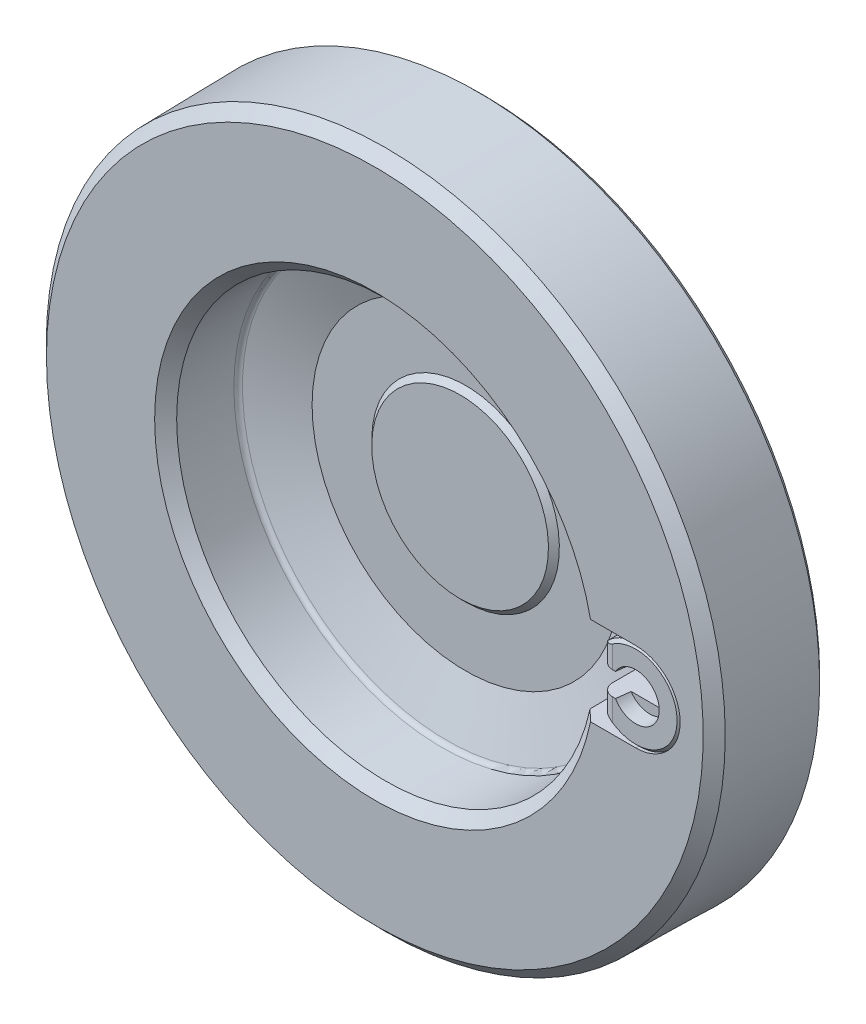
ISO-10303-21;
HEADER;
FILE_DESCRIPTION(('STEP AP214'),'2;1');
FILE_NAME('part.step','',(''),(''),'','','');
FILE_SCHEMA(('AUTOMOTIVE_DESIGN { 1 0 10303 214 1 1 1 1 }'));
ENDSEC;
DATA;
#1=APPLICATION_CONTEXT('core data for automotive mechanical design processes');
#2=APPLICATION_PROTOCOL_DEFINITION('international standard','automotive_design',2000,#1);
#3=PRODUCT_CONTEXT('',#1,'mechanical');
#4=PRODUCT('Part','Part','',(#3));
#5=PRODUCT_RELATED_PRODUCT_CATEGORY('part','',(#4));
#6=PRODUCT_DEFINITION_FORMATION('','',#4);
#7=PRODUCT_DEFINITION_CONTEXT('part definition',#1,'design');
#8=PRODUCT_DEFINITION('design','',#6,#7);
#9=PRODUCT_DEFINITION_SHAPE('','',#8);
#10=(LENGTH_UNIT() NAMED_UNIT(*) SI_UNIT(.MILLI.,.METRE.));
#11=(NAMED_UNIT(*) PLANE_ANGLE_UNIT() SI_UNIT($,.RADIAN.));
#12=(NAMED_UNIT(*) SI_UNIT($,.STERADIAN.) SOLID_ANGLE_UNIT());
#13=UNCERTAINTY_MEASURE_WITH_UNIT(LENGTH_MEASURE(1.E-05),#10,'distance_accuracy_value','');
#14=(GEOMETRIC_REPRESENTATION_CONTEXT(3) GLOBAL_UNCERTAINTY_ASSIGNED_CONTEXT((#13)) GLOBAL_UNIT_ASSIGNED_CONTEXT((#10,
#11,#12)) REPRESENTATION_CONTEXT('',''));
#15=CARTESIAN_POINT('',(0.,0.,0.));
#16=DIRECTION('',(0.,0.,1.));
#17=DIRECTION('',(1.,0.,0.));
#18=AXIS2_PLACEMENT_3D('',#15,#16,#17);
#19=CARTESIAN_POINT('',(76.5,13.,68.));
#20=DIRECTION('',(0.,-1.,0.));
#21=DIRECTION('',(1.,0.,0.));
#22=AXIS2_PLACEMENT_3D('',#19,#20,#21);
#23=PLANE('',#22);
#24=CARTESIAN_POINT('',(76.5,13.,54.75));
#25=DIRECTION('',(0.,-1.,0.));
#26=DIRECTION('',(1.,0.,0.));
#27=AXIS2_PLACEMENT_3D('',#24,#25,#26);
#28=CIRCLE('',#27,1.94999999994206);
#29=CARTESIAN_POINT('',(76.5,13.,56.6999999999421));
#30=VERTEX_POINT('',#29);
#31=CARTESIAN_POINT('',(76.5,13.,52.8000000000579));
#32=VERTEX_POINT('',#31);
#33=EDGE_CURVE('E461',#30,#32,#28,.T.);
#34=ORIENTED_EDGE('',*,*,#33,.F.);
#35=DIRECTION('',(0.,0.,1.));
#36=VECTOR('',#35,1.);
#37=CARTESIAN_POINT('',(76.5,13.,68.));
#38=LINE('',#37,#36);
#39=CARTESIAN_POINT('',(76.5,13.,57.35));
#40=VERTEX_POINT('',#39);
#41=EDGE_CURVE('E1021',#30,#40,#38,.T.);
#42=ORIENTED_EDGE('',*,*,#41,.T.);
#43=CARTESIAN_POINT('',(76.5,13.,67.1));
#44=VERTEX_POINT('',#43);
#45=EDGE_CURVE('E1022',#40,#44,#38,.T.);
#46=ORIENTED_EDGE('',*,*,#45,.T.);
#47=CARTESIAN_POINT('',(76.5,13.,68.));
#48=VERTEX_POINT('',#47);
#49=EDGE_CURVE('E626',#44,#48,#38,.T.);
#50=ORIENTED_EDGE('',*,*,#49,.T.);
#51=DIRECTION('',(-1.,0.,0.));
#52=VECTOR('',#51,1.);
#53=CARTESIAN_POINT('',(-64.5527182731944,13.,68.));
#54=LINE('',#53,#52);
#55=CARTESIAN_POINT('',(63.2301623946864,13.,68.));
#56=VERTEX_POINT('',#55);
#57=EDGE_CURVE('E598',#48,#56,#54,.T.);
#58=ORIENTED_EDGE('',*,*,#57,.T.);
#59=CARTESIAN_POINT('',(63.2301623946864,13.,68.));
#60=CARTESIAN_POINT('',(62.6758551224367,13.,67.4664280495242));
#61=CARTESIAN_POINT('',(62.121394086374,13.,66.9330160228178));
#62=CARTESIAN_POINT('',(61.0121644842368,13.,65.8665118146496));
#63=CARTESIAN_POINT('',(60.4573959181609,13.,65.3334196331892));
#64=CARTESIAN_POINT('',(59.9024735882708,13.,64.8004873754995));
#65=B_SPLINE_CURVE_WITH_KNOTS('',3,(#59,#60,#61,#62,#63,#64),.UNSPECIFIED.,.F.,.F.,(4,2,4),(0.,
2.30815919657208,4.61631840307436),.UNSPECIFIED.);
#66=CARTESIAN_POINT('',(59.9024735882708,13.,64.8004873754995));
#67=VERTEX_POINT('',#66);
#68=EDGE_CURVE('E567',#56,#67,#65,.T.);
#69=ORIENTED_EDGE('',*,*,#68,.T.);
#70=CARTESIAN_POINT('',(59.9024735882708,13.,64.8004873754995));
#71=CARTESIAN_POINT('',(59.8534110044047,13.,62.0536337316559));
#72=CARTESIAN_POINT('',(59.8043456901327,13.,59.3067801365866));
#73=CARTESIAN_POINT('',(59.7062096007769,13.,53.8130730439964));
#74=CARTESIAN_POINT('',(59.6571388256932,13.,51.0662195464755));
#75=CARTESIAN_POINT('',(59.6080653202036,13.,48.3193660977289));
#76=B_SPLINE_CURVE_WITH_KNOTS('',3,(#70,#71,#72,#73,#74,#75),.UNSPECIFIED.,.F.,.F.,(4,2,4),(0.,
8.24187531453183,16.4837506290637),.UNSPECIFIED.);
#77=CARTESIAN_POINT('',(59.6080653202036,13.,48.3193660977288));
#78=VERTEX_POINT('',#77);
#79=EDGE_CURVE('E528',#67,#78,#76,.T.);
#80=ORIENTED_EDGE('',*,*,#79,.T.);
#81=CARTESIAN_POINT('',(59.6080653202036,13.,48.3193660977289));
#82=CARTESIAN_POINT('',(59.6072745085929,13.,48.2750887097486));
#83=CARTESIAN_POINT('',(59.6046009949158,13.,48.2308665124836));
#84=CARTESIAN_POINT('',(59.5955183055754,13.,48.1428116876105));
#85=CARTESIAN_POINT('',(59.5891094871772,13.,48.0989790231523));
#86=CARTESIAN_POINT('',(59.5643599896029,13.,47.9686612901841));
#87=CARTESIAN_POINT('',(59.5404925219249,13.,47.8831607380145));
#88=CARTESIAN_POINT('',(59.4787769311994,13.,47.7174036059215));
#89=CARTESIAN_POINT('',(59.4409262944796,13.,47.637147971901));
#90=CARTESIAN_POINT('',(59.3524183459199,13.,47.4840320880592));
#91=CARTESIAN_POINT('',(59.3017607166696,13.,47.4111720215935));
#92=CARTESIAN_POINT('',(59.188583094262,13.,47.2740678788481));
#93=CARTESIAN_POINT('',(59.1259447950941,13.,47.2099216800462));
#94=CARTESIAN_POINT('',(58.9909821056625,13.,47.0927844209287));
#95=CARTESIAN_POINT('',(58.9186595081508,13.,47.0397913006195));
#96=CARTESIAN_POINT('',(58.7932749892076,13.,46.9627534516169));
#97=CARTESIAN_POINT('',(58.7423975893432,13.,46.9350857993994));
#98=CARTESIAN_POINT('',(58.6381364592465,13.,46.8852686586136));
#99=CARTESIAN_POINT('',(58.5847580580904,13.,46.8631080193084));
#100=CARTESIAN_POINT('',(58.5303508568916,13.,46.8437817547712));
#101=B_SPLINE_CURVE_WITH_KNOTS('',3,(#81,#82,#83,#84,#85,#86,#87,#88,#89,#90,#91,#92,#93,#94,
#95,#96,#97,#98,#99,#100),.UNSPECIFIED.,.F.,.F.,(4,2,2,2,2,2,2,2,2,4),(0.,0.132770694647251,
0.265528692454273,0.530464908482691,0.795448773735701,1.06043920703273,1.32819575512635,
1.5959028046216,1.76934974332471,1.94244256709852),.UNSPECIFIED.);
#102=CARTESIAN_POINT('',(58.5303508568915,13.,46.8437817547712));
#103=VERTEX_POINT('',#102);
#104=EDGE_CURVE('E536',#78,#103,#101,.T.);
#105=ORIENTED_EDGE('',*,*,#104,.T.);
#106=CARTESIAN_POINT('',(58.5303508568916,13.,46.8437817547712));
#107=CARTESIAN_POINT('',(57.899115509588,13.,46.6194848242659));
#108=CARTESIAN_POINT('',(57.2678210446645,13.,46.3953545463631));
#109=CARTESIAN_POINT('',(56.0051138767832,13.,45.9474272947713));
#110=CARTESIAN_POINT('',(55.3737011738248,13.,45.7236303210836));
#111=CARTESIAN_POINT('',(54.7422293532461,13.,45.5));
#112=B_SPLINE_CURVE_WITH_KNOTS('',3,(#106,#107,#108,#109,#110,#111),.UNSPECIFIED.,.F.,.F.,(4,2,
4),(0.,2.00970240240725,4.01940481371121),.UNSPECIFIED.);
#113=CARTESIAN_POINT('',(54.7422293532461,13.,45.5));
#114=VERTEX_POINT('',#113);
#115=EDGE_CURVE('E543',#103,#114,#112,.T.);
#116=ORIENTED_EDGE('',*,*,#115,.T.);
#117=DIRECTION('',(1.,0.,0.));
#118=VECTOR('',#117,1.);
#119=CARTESIAN_POINT('',(76.5,13.,45.5));
#120=LINE('',#119,#118);
#121=CARTESIAN_POINT('',(76.5,13.,45.5));
#122=VERTEX_POINT('',#121);
#123=EDGE_CURVE('E550',#114,#122,#120,.T.);
#124=ORIENTED_EDGE('',*,*,#123,.T.);
#125=CARTESIAN_POINT('',(76.5,13.,52.15));
#126=VERTEX_POINT('',#125);
#127=EDGE_CURVE('E537',#122,#126,#38,.T.);
#128=ORIENTED_EDGE('',*,*,#127,.T.);
#129=EDGE_CURVE('E645',#126,#32,#38,.T.);
#130=ORIENTED_EDGE('',*,*,#129,.T.);
#131=EDGE_LOOP('',(#34,#42,#46,#50,#58,#69,#80,#105,#116,#124,#128,#130));
#132=FACE_BOUND('',#131,.T.);
#133=ADVANCED_FACE('F15',(#132),#23,.T.);
#134=CARTESIAN_POINT('',(76.5,0.,68.));
#135=DIRECTION('',(0.,0.,1.));
#136=DIRECTION('',(0.,1.,0.));
#137=AXIS2_PLACEMENT_3D('',#134,#135,#136);
#138=CYLINDRICAL_SURFACE('',#137,13.);
#139=ORIENTED_EDGE('',*,*,#41,.F.);
#140=CARTESIAN_POINT('',(76.2398,12.9973957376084,56.6851897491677));
#141=CARTESIAN_POINT('',(76.3028729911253,12.9986608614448,56.6923943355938));
#142=CARTESIAN_POINT('',(76.3662239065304,12.9994667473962,56.6969740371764));
#143=CARTESIAN_POINT('',(76.493091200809,13.0001526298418,56.700868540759));
#144=CARTESIAN_POINT('',(76.5566075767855,13.0000326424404,56.700183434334));
#145=CARTESIAN_POINT('',(76.7467292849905,12.9982736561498,56.6902133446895));
#146=CARTESIAN_POINT('',(76.8730012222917,12.9952375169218,56.673024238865));
#147=CARTESIAN_POINT('',(77.1207249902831,12.9857653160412,56.617892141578));
#148=CARTESIAN_POINT('',(77.2421773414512,12.9793296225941,56.579951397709));
#149=CARTESIAN_POINT('',(77.4767395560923,12.9637874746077,56.4840697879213));
#150=CARTESIAN_POINT('',(77.5898516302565,12.9546817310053,56.4261342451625));
#151=CARTESIAN_POINT('',(77.8022633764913,12.935041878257,56.2925777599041));
#152=CARTESIAN_POINT('',(77.9017673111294,12.9245350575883,56.2172784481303));
#153=CARTESIAN_POINT('',(78.0856813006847,12.9032629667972,56.0500270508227));
#154=CARTESIAN_POINT('',(78.1700935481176,12.8924977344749,55.9580773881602));
#155=CARTESIAN_POINT('',(78.3156955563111,12.8727752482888,55.7657246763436));
#156=CARTESIAN_POINT('',(78.3779693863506,12.8637484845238,55.6661518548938));
#157=CARTESIAN_POINT('',(78.4829737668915,12.8479826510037,55.4570283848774));
#158=CARTESIAN_POINT('',(78.5257213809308,12.8412415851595,55.3474865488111));
#159=CARTESIAN_POINT('',(78.5862905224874,12.8315332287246,55.1327745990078));
#160=CARTESIAN_POINT('',(78.6060914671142,12.8282686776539,55.0281750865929));
#161=CARTESIAN_POINT('',(78.6267158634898,12.8248664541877,54.8170832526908));
#162=CARTESIAN_POINT('',(78.6275476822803,12.8247274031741,54.7105917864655));
#163=CARTESIAN_POINT('',(78.6107850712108,12.8274954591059,54.5062234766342));
#164=CARTESIAN_POINT('',(78.5944018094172,12.8302023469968,54.4082415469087));
#165=CARTESIAN_POINT('',(78.5458334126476,12.838035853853,54.2163955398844));
#166=CARTESIAN_POINT('',(78.513647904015,12.843162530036,54.122531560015));
#167=CARTESIAN_POINT('',(78.4342314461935,12.8553636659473,53.9398895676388));
#168=CARTESIAN_POINT('',(78.3867824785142,12.8624661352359,53.8512087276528));
#169=CARTESIAN_POINT('',(78.2787542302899,12.8778493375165,53.6823691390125));
#170=CARTESIAN_POINT('',(78.2181706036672,12.8861304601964,53.6022132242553));
#171=CARTESIAN_POINT('',(78.0805957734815,12.9037544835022,53.4460025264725));
#172=CARTESIAN_POINT('',(78.0026938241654,12.9131298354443,53.3707542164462));
#173=CARTESIAN_POINT('',(77.836207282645,12.9314177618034,53.2331562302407));
#174=CARTESIAN_POINT('',(77.7476200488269,12.9403302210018,53.1708097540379));
#175=CARTESIAN_POINT('',(77.5539337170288,12.9576023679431,53.0551284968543));
#176=CARTESIAN_POINT('',(77.4480682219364,12.9658457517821,53.0030567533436));
#177=CARTESIAN_POINT('',(77.2293075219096,12.9799903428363,52.9161859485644));
#178=CARTESIAN_POINT('',(77.1164082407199,12.9858901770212,52.8813970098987));
#179=CARTESIAN_POINT('',(76.8768689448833,12.9951313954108,52.8275764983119));
#180=CARTESIAN_POINT('',(76.7498649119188,12.9982207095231,52.8100868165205));
#181=CARTESIAN_POINT('',(76.5586030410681,13.000025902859,52.7998549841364));
#182=CARTESIAN_POINT('',(76.4946849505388,13.0001554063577,52.7991158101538));
#183=CARTESIAN_POINT('',(76.3670181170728,12.9994767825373,52.8029689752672));
#184=CARTESIAN_POINT('',(76.3032693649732,12.9986687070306,52.8075610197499));
#185=CARTESIAN_POINT('',(76.2398,12.9973957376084,52.8148102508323));
#186=B_SPLINE_CURVE_WITH_KNOTS('',3,(#140,#141,#142,#143,#144,#145,#146,#147,#148,#149,#150,
#151,#152,#153,#154,#155,#156,#157,#158,#159,#160,#161,#162,#163,#164,#165,#166,#167,#168,#169,
#170,#171,#172,#173,#174,#175,#176,#177,#178,#179,#180,#181,#182,#183,#184,#185),.UNSPECIFIED.,
.F.,.F.,(4,2,2,2,2,2,2,2,2,2,2,2,2,2,2,2,2,2,2,2,2,2,4),(0.,0.190369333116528,0.380735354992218,
0.761187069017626,1.1415975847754,1.52190690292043,1.89566906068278,2.26937687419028,
2.62081582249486,2.97194706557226,3.28977856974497,3.60746987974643,3.90421682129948,
4.20097078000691,4.50216716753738,4.80346336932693,5.12824100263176,5.45309909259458,
5.80633616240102,6.15977988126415,6.54246695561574,6.73403804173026,6.92559854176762),.UNSPECIFIED.);
#187=EDGE_CURVE('E19',#30,#32,#186,.T.);
#188=ORIENTED_EDGE('',*,*,#187,.T.);
#189=ORIENTED_EDGE('',*,*,#129,.F.);
#190=CARTESIAN_POINT('',(76.5,13.,57.35));
#191=CARTESIAN_POINT('',(76.5723612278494,13.000005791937,57.3500078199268));
#192=CARTESIAN_POINT('',(76.644718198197,12.9993959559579,57.3469792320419));
#193=CARTESIAN_POINT('',(76.7889007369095,12.996987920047,57.3349098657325));
#194=CARTESIAN_POINT('',(76.8607263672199,12.995189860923,57.325869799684));
#195=CARTESIAN_POINT('',(77.0032345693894,12.990451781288,57.3018559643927));
#196=CARTESIAN_POINT('',(77.0739186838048,12.9875134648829,57.28689104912));
#197=CARTESIAN_POINT('',(77.2137318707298,12.9805814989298,57.2511597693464));
#198=CARTESIAN_POINT('',(77.2828609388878,12.9765878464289,57.2303933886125));
#199=CARTESIAN_POINT('',(77.4872075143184,12.9631775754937,57.159596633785));
#200=CARTESIAN_POINT('',(77.6194937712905,12.9523277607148,57.1010500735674));
#201=CARTESIAN_POINT('',(77.872304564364,12.9279918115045,56.9630425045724));
#202=CARTESIAN_POINT('',(77.9928280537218,12.9145054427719,56.8835796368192));
#203=CARTESIAN_POINT('',(78.2203920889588,12.8861770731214,56.704845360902));
#204=CARTESIAN_POINT('',(78.3272532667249,12.8713207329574,56.6053474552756));
#205=CARTESIAN_POINT('',(78.5228893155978,12.8420299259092,56.3898495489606));
#206=CARTESIAN_POINT('',(78.6116611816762,12.8275955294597,56.2738468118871));
#207=CARTESIAN_POINT('',(78.769364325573,12.8006431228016,56.0273345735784));
#208=CARTESIAN_POINT('',(78.838108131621,12.7881437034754,55.8967029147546));
#209=CARTESIAN_POINT('',(78.9525973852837,12.7666824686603,55.6254594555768));
#210=CARTESIAN_POINT('',(78.9983463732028,12.7577201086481,55.4848491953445));
#211=CARTESIAN_POINT('',(79.0649653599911,12.74449301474,55.1995823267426));
#212=CARTESIAN_POINT('',(79.0861531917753,12.7401683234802,55.0550027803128));
#213=CARTESIAN_POINT('',(79.1040356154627,12.7365257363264,54.7642778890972));
#214=CARTESIAN_POINT('',(79.1007321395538,12.7372074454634,54.6181326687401));
#215=CARTESIAN_POINT('',(79.0699818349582,12.7434463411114,54.3307578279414));
#216=CARTESIAN_POINT('',(79.0429000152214,12.7489298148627,54.1894873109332));
#217=CARTESIAN_POINT('',(78.9659381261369,12.7640382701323,53.9135372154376));
#218=CARTESIAN_POINT('',(78.9160571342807,12.7736634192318,53.7788579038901));
#219=CARTESIAN_POINT('',(78.7945634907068,12.7960462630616,53.5188582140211));
#220=CARTESIAN_POINT('',(78.7228058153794,12.8088247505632,53.3936074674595));
#221=CARTESIAN_POINT('',(78.5597001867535,12.83606055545,53.1567921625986));
#222=CARTESIAN_POINT('',(78.4683506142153,12.8505180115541,53.0452287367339));
#223=CARTESIAN_POINT('',(78.2667135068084,12.8798006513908,52.8368571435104));
#224=CARTESIAN_POINT('',(78.1561166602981,12.8946277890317,52.7403483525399));
#225=CARTESIAN_POINT('',(77.9201114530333,12.9227466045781,52.5671797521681));
#226=CARTESIAN_POINT('',(77.7946990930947,12.9360378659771,52.4905253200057));
#227=CARTESIAN_POINT('',(77.5322724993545,12.9596220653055,52.3591840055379));
#228=CARTESIAN_POINT('',(77.3952343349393,12.9699086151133,52.3045438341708));
#229=CARTESIAN_POINT('',(77.1137608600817,12.9862647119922,52.2192192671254));
#230=CARTESIAN_POINT('',(76.9693368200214,12.9923404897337,52.1884994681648));
#231=CARTESIAN_POINT('',(76.7697990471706,12.9973123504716,52.1634670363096));
#232=CARTESIAN_POINT('',(76.7159205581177,12.9983192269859,52.1584151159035));
#233=CARTESIAN_POINT('',(76.6080361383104,12.9996624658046,52.1516858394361));
#234=CARTESIAN_POINT('',(76.5540305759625,12.9999999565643,52.1500028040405));
#235=CARTESIAN_POINT('',(76.5,13.,52.15));
#236=B_SPLINE_CURVE_WITH_KNOTS('',3,(#190,#191,#192,#193,#194,#195,#196,#197,#198,#199,#200,
#201,#202,#203,#204,#205,#206,#207,#208,#209,#210,#211,#212,#213,#214,#215,#216,#217,#218,#219,
#220,#221,#222,#223,#224,#225,#226,#227,#228,#229,#230,#231,#232,#233,#234,#235),.UNSPECIFIED.,
.F.,.F.,(4,2,2,2,2,2,2,2,2,2,2,2,2,2,2,2,2,2,2,2,2,2,4),(0.,0.21701030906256,0.433994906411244,
0.650656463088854,0.867318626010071,1.30031410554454,1.73334808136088,2.17158421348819,
2.60989308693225,3.0521818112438,3.4944024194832,3.93083424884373,4.3672316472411,
4.79704500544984,5.22687575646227,5.65962026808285,6.09240055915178,6.53291633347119,
6.97355129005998,7.41511634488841,7.85602661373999,8.01831502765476,8.18032962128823),.UNSPECIFIED.);
#237=EDGE_CURVE('E447',#40,#126,#236,.T.);
#238=ORIENTED_EDGE('',*,*,#237,.F.);
#239=EDGE_LOOP('',(#139,#188,#189,#238));
#240=FACE_BOUND('',#239,.T.);
#241=ADVANCED_FACE('F482',(#240),#138,.F.);
#242=CARTESIAN_POINT('',(0.,-13.,68.));
#243=DIRECTION('',(0.,1.,0.));
#244=DIRECTION('',(-1.,0.,0.));
#245=AXIS2_PLACEMENT_3D('',#242,#243,#244);
#246=PLANE('',#245);
#247=CARTESIAN_POINT('',(76.5,-13.,54.75));
#248=DIRECTION('',(0.,1.,0.));
#249=DIRECTION('',(-1.,0.,0.));
#250=AXIS2_PLACEMENT_3D('',#247,#248,#249);
#251=CIRCLE('',#250,1.95000000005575);
#252=CARTESIAN_POINT('',(76.5,-13.,52.7999999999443));
#253=VERTEX_POINT('',#252);
#254=CARTESIAN_POINT('',(76.5,-13.,56.7000000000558));
#255=VERTEX_POINT('',#254);
#256=EDGE_CURVE('E616',#253,#255,#251,.T.);
#257=ORIENTED_EDGE('',*,*,#256,.F.);
#258=DIRECTION('',(0.,0.,1.));
#259=VECTOR('',#258,1.);
#260=CARTESIAN_POINT('',(76.5,-13.,68.));
#261=LINE('',#260,#259);
#262=CARTESIAN_POINT('',(76.5,-13.,52.15));
#263=VERTEX_POINT('',#262);
#264=EDGE_CURVE('E1092',#253,#263,#261,.F.);
#265=ORIENTED_EDGE('',*,*,#264,.T.);
#266=CARTESIAN_POINT('',(76.5,-13.,45.5));
#267=VERTEX_POINT('',#266);
#268=EDGE_CURVE('E594',#263,#267,#261,.F.);
#269=ORIENTED_EDGE('',*,*,#268,.T.);
#270=DIRECTION('',(-1.,0.,0.));
#271=VECTOR('',#270,1.);
#272=CARTESIAN_POINT('',(0.,-13.,45.5));
#273=LINE('',#272,#271);
#274=CARTESIAN_POINT('',(54.7422293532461,-13.,45.5));
#275=VERTEX_POINT('',#274);
#276=EDGE_CURVE('E639',#267,#275,#273,.T.);
#277=ORIENTED_EDGE('',*,*,#276,.T.);
#278=CARTESIAN_POINT('',(54.7422293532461,-13.,45.5));
#279=CARTESIAN_POINT('',(55.3737011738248,-13.,45.7236303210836));
#280=CARTESIAN_POINT('',(56.0051138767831,-13.,45.9474272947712));
#281=CARTESIAN_POINT('',(57.2678210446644,-13.,46.3953545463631));
#282=CARTESIAN_POINT('',(57.8991155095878,-13.,46.6194848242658));
#283=CARTESIAN_POINT('',(58.5303508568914,-13.,46.8437817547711));
#284=B_SPLINE_CURVE_WITH_KNOTS('',3,(#278,#279,#280,#281,#282,#283),.UNSPECIFIED.,.F.,.F.,(4,2,
4),(0.,2.00970241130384,4.01940481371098),.UNSPECIFIED.);
#285=CARTESIAN_POINT('',(58.5303508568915,-13.,46.8437817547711));
#286=VERTEX_POINT('',#285);
#287=EDGE_CURVE('E560',#275,#286,#284,.T.);
#288=ORIENTED_EDGE('',*,*,#287,.T.);
#289=CARTESIAN_POINT('',(58.5303508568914,-13.,46.8437817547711));
#290=CARTESIAN_POINT('',(58.5737662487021,-13.,46.8592085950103));
#291=CARTESIAN_POINT('',(58.6165217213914,-13.,46.8764309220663));
#292=CARTESIAN_POINT('',(58.700453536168,-13.,46.9143747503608));
#293=CARTESIAN_POINT('',(58.741629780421,-13.,46.9350964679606));
#294=CARTESIAN_POINT('',(58.8623414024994,-13.,47.0023411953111));
#295=CARTESIAN_POINT('',(58.9391156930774,-13.,47.0539636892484));
#296=CARTESIAN_POINT('',(59.0828837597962,-13.,47.169460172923));
#297=CARTESIAN_POINT('',(59.1498685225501,-13.,47.2333453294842));
#298=CARTESIAN_POINT('',(59.2719227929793,-13.,47.3716215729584));
#299=CARTESIAN_POINT('',(59.326996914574,-13.,47.4460085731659));
#300=CARTESIAN_POINT('',(59.4226567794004,-13.,47.6018709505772));
#301=CARTESIAN_POINT('',(59.4634672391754,-13.,47.6832086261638));
#302=CARTESIAN_POINT('',(59.530504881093,-13.,47.8516728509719));
#303=CARTESIAN_POINT('',(59.5567429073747,-13.,47.9387950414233));
#304=CARTESIAN_POINT('',(59.5852980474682,-13.,48.075499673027));
#305=CARTESIAN_POINT('',(59.5930671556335,-13.,48.1240039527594));
#306=CARTESIAN_POINT('',(59.6040098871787,-13.,48.2214393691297));
#307=CARTESIAN_POINT('',(59.6071917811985,-13.,48.2703695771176));
#308=CARTESIAN_POINT('',(59.6080653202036,-13.,48.3193660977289));
#309=B_SPLINE_CURVE_WITH_KNOTS('',3,(#289,#290,#291,#292,#293,#294,#295,#296,#297,#298,#299,
#300,#301,#302,#303,#304,#305,#306,#307,#308),.UNSPECIFIED.,.F.,.F.,(4,2,2,2,2,2,2,2,2,4),(0.,
0.138142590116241,0.276293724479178,0.552419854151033,0.828798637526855,1.10507016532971,
1.37676898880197,1.64826535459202,1.79544036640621,1.94234969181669),.UNSPECIFIED.);
#310=CARTESIAN_POINT('',(59.6080653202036,-13.,48.3193660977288));
#311=VERTEX_POINT('',#310);
#312=EDGE_CURVE('E566',#286,#311,#309,.T.);
#313=ORIENTED_EDGE('',*,*,#312,.T.);
#314=CARTESIAN_POINT('',(59.6080653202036,-13.,48.3193660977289));
#315=CARTESIAN_POINT('',(59.6571388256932,-13.,51.0662195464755));
#316=CARTESIAN_POINT('',(59.7062096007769,-13.,53.8130730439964));
#317=CARTESIAN_POINT('',(59.8043456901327,-13.,59.3067801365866));
#318=CARTESIAN_POINT('',(59.8534110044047,-13.,62.0536337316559));
#319=CARTESIAN_POINT('',(59.9024735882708,-13.,64.8004873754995));
#320=B_SPLINE_CURVE_WITH_KNOTS('',3,(#314,#315,#316,#317,#318,#319),.UNSPECIFIED.,.F.,.F.,(4,2,
4),(0.,8.24187531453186,16.4837506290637),.UNSPECIFIED.);
#321=CARTESIAN_POINT('',(59.9024735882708,-13.,64.8004873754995));
#322=VERTEX_POINT('',#321);
#323=EDGE_CURVE('E519',#311,#322,#320,.T.);
#324=ORIENTED_EDGE('',*,*,#323,.T.);
#325=CARTESIAN_POINT('',(59.9024735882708,-13.,64.8004873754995));
#326=CARTESIAN_POINT('',(60.4573959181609,-13.,65.3334196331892));
#327=CARTESIAN_POINT('',(61.0121644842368,-13.,65.8665118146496));
#328=CARTESIAN_POINT('',(62.121394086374,-13.,66.9330160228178));
#329=CARTESIAN_POINT('',(62.6758551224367,-13.,67.4664280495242));
#330=CARTESIAN_POINT('',(63.2301623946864,-13.,68.));
#331=B_SPLINE_CURVE_WITH_KNOTS('',3,(#325,#326,#327,#328,#329,#330),.UNSPECIFIED.,.F.,.F.,(4,2,
4),(0.,2.30815920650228,4.61631840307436),.UNSPECIFIED.);
#332=CARTESIAN_POINT('',(63.2301623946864,-13.,68.));
#333=VERTEX_POINT('',#332);
#334=EDGE_CURVE('E587',#322,#333,#331,.T.);
#335=ORIENTED_EDGE('',*,*,#334,.T.);
#336=DIRECTION('',(-1.,0.,0.));
#337=VECTOR('',#336,1.);
#338=CARTESIAN_POINT('',(-64.5527182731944,-13.,68.));
#339=LINE('',#338,#337);
#340=CARTESIAN_POINT('',(76.5,-13.,68.));
#341=VERTEX_POINT('',#340);
#342=EDGE_CURVE('E603',#333,#341,#339,.F.);
#343=ORIENTED_EDGE('',*,*,#342,.T.);
#344=CARTESIAN_POINT('',(76.5,-13.,67.1));
#345=VERTEX_POINT('',#344);
#346=EDGE_CURVE('E642',#341,#345,#261,.F.);
#347=ORIENTED_EDGE('',*,*,#346,.T.);
#348=CARTESIAN_POINT('',(76.5,-13.,57.35));
#349=VERTEX_POINT('',#348);
#350=EDGE_CURVE('E442',#345,#349,#261,.F.);
#351=ORIENTED_EDGE('',*,*,#350,.T.);
#352=EDGE_CURVE('E1095',#349,#255,#261,.F.);
#353=ORIENTED_EDGE('',*,*,#352,.T.);
#354=EDGE_LOOP('',(#257,#265,#269,#277,#288,#313,#324,#335,#343,#347,#351,#353));
#355=FACE_BOUND('',#354,.T.);
#356=ADVANCED_FACE('F576',(#355),#246,.T.);
#357=ORIENTED_EDGE('',*,*,#264,.F.);
#358=CARTESIAN_POINT('',(76.2398,-12.9973957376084,52.8148102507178));
#359=CARTESIAN_POINT('',(76.3028729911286,-12.9986608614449,52.8076056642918));
#360=CARTESIAN_POINT('',(76.3662239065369,-12.9994667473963,52.8030259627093));
#361=CARTESIAN_POINT('',(76.4930912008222,-13.0001526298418,52.7991314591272));
#362=CARTESIAN_POINT('',(76.556607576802,-13.0000326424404,52.7998165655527));
#363=CARTESIAN_POINT('',(76.7467292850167,-12.9982736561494,52.8097866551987));
#364=CARTESIAN_POINT('',(76.8730012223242,-12.9952375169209,52.8269757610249));
#365=CARTESIAN_POINT('',(77.1207249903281,-12.9857653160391,52.8821078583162));
#366=CARTESIAN_POINT('',(77.2421773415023,-12.9793296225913,52.9200486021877));
#367=CARTESIAN_POINT('',(77.4767395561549,-12.9637874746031,53.0159302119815));
#368=CARTESIAN_POINT('',(77.5898516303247,-12.9546817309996,53.0738657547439));
#369=CARTESIAN_POINT('',(77.8022633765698,-12.9350418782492,53.2074222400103));
#370=CARTESIAN_POINT('',(77.9017673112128,-12.9245350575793,53.2827215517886));
#371=CARTESIAN_POINT('',(78.085681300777,-12.9032629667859,53.4499729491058));
#372=CARTESIAN_POINT('',(78.170093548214,-12.8924977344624,53.5419226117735));
#373=CARTESIAN_POINT('',(78.3156955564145,-12.8727752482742,53.7342753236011));
#374=CARTESIAN_POINT('',(78.3779693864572,-12.8637484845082,53.8338481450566));
#375=CARTESIAN_POINT('',(78.4829737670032,-12.8479826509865,54.0429716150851));
#376=CARTESIAN_POINT('',(78.5257213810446,-12.8412415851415,54.1525134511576));
#377=CARTESIAN_POINT('',(78.586290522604,-12.8315332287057,54.3672254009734));
#378=CARTESIAN_POINT('',(78.6060914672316,-12.8282686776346,54.4718249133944));
#379=CARTESIAN_POINT('',(78.626715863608,-12.8248664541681,54.6829167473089));
#380=CARTESIAN_POINT('',(78.6275476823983,-12.8247274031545,54.7894082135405));
#381=CARTESIAN_POINT('',(78.6107850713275,-12.8274954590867,54.9937765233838));
#382=CARTESIAN_POINT('',(78.5944018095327,-12.830202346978,55.0917584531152));
#383=CARTESIAN_POINT('',(78.5458334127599,-12.8380358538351,55.2836044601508));
#384=CARTESIAN_POINT('',(78.5136479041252,-12.8431625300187,55.3774684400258));
#385=CARTESIAN_POINT('',(78.4342314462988,-12.8553636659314,55.5601104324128));
#386=CARTESIAN_POINT('',(78.3867824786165,-12.8624661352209,55.648791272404));
#387=CARTESIAN_POINT('',(78.2787542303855,-12.8778493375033,55.8176308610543));
#388=CARTESIAN_POINT('',(78.2181706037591,-12.8861304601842,55.8977867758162));
#389=CARTESIAN_POINT('',(78.0805957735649,-12.903754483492,56.053997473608));
#390=CARTESIAN_POINT('',(78.0026938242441,-12.9131298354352,56.1292457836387));
#391=CARTESIAN_POINT('',(77.8362072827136,-12.9314177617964,56.266843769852));
#392=CARTESIAN_POINT('',(77.7476200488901,-12.9403302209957,56.3291902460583));
#393=CARTESIAN_POINT('',(77.5539337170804,-12.9576023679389,56.4448715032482));
#394=CARTESIAN_POINT('',(77.4480682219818,-12.9658457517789,56.4969432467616));
#395=CARTESIAN_POINT('',(77.2293075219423,-12.9799903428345,56.5838140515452));
#396=CARTESIAN_POINT('',(77.116408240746,-12.98589017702,56.6186029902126));
#397=CARTESIAN_POINT('',(76.8768689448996,-12.9951313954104,56.6724235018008));
#398=CARTESIAN_POINT('',(76.7498649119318,-12.9982207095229,56.6899131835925));
#399=CARTESIAN_POINT('',(76.5586030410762,-13.000025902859,56.7001450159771));
#400=CARTESIAN_POINT('',(76.4946849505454,-13.0001554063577,56.7008841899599));
#401=CARTESIAN_POINT('',(76.3670181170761,-12.9994767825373,56.6970310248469));
#402=CARTESIAN_POINT('',(76.3032693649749,-12.9986687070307,56.6924389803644));
#403=CARTESIAN_POINT('',(76.2398,-12.9973957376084,56.6851897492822));
#404=B_SPLINE_CURVE_WITH_KNOTS('',3,(#358,#359,#360,#361,#362,#363,#364,#365,#366,#367,#368,
#369,#370,#371,#372,#373,#374,#375,#376,#377,#378,#379,#380,#381,#382,#383,#384,#385,#386,#387,
#388,#389,#390,#391,#392,#393,#394,#395,#396,#397,#398,#399,#400,#401,#402,#403),.UNSPECIFIED.,
.F.,.F.,(4,2,2,2,2,2,2,2,2,2,2,2,2,2,2,2,2,2,2,2,2,2,4),(0.,0.19036933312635,0.380735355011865,
0.761187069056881,1.1415975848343,1.52190690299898,1.89566906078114,2.26937687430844,
2.62081582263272,2.97194706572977,3.28977856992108,3.60746987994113,3.90421682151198,
4.20097078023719,4.50216716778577,4.80346336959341,5.12824100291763,5.45309909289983,
5.80633616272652,6.15977988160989,6.54246695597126,6.73403804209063,6.92559854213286),.UNSPECIFIED.);
#405=EDGE_CURVE('E446',#253,#255,#404,.T.);
#406=ORIENTED_EDGE('',*,*,#405,.T.);
#407=ORIENTED_EDGE('',*,*,#352,.F.);
#408=CARTESIAN_POINT('',(76.5,-13.,52.15));
#409=CARTESIAN_POINT('',(76.5723612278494,-13.000005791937,52.1499921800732));
#410=CARTESIAN_POINT('',(76.644718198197,-12.9993959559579,52.1530207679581));
#411=CARTESIAN_POINT('',(76.7889007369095,-12.996987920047,52.1650901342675));
#412=CARTESIAN_POINT('',(76.8607263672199,-12.995189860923,52.174130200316));
#413=CARTESIAN_POINT('',(77.0032345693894,-12.990451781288,52.1981440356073));
#414=CARTESIAN_POINT('',(77.0739186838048,-12.9875134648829,52.21310895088));
#415=CARTESIAN_POINT('',(77.2137318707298,-12.9805814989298,52.2488402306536));
#416=CARTESIAN_POINT('',(77.2828609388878,-12.9765878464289,52.2696066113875));
#417=CARTESIAN_POINT('',(77.4872075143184,-12.9631775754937,52.340403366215));
#418=CARTESIAN_POINT('',(77.6194937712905,-12.9523277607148,52.3989499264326));
#419=CARTESIAN_POINT('',(77.872304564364,-12.9279918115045,52.5369574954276));
#420=CARTESIAN_POINT('',(77.9928280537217,-12.9145054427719,52.6164203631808));
#421=CARTESIAN_POINT('',(78.2203920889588,-12.8861770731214,52.795154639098));
#422=CARTESIAN_POINT('',(78.3272532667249,-12.8713207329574,52.8946525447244));
#423=CARTESIAN_POINT('',(78.5228893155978,-12.8420299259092,53.1101504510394));
#424=CARTESIAN_POINT('',(78.6116611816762,-12.8275955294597,53.2261531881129));
#425=CARTESIAN_POINT('',(78.769364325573,-12.8006431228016,53.4726654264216));
#426=CARTESIAN_POINT('',(78.838108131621,-12.7881437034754,53.6032970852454));
#427=CARTESIAN_POINT('',(78.9525973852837,-12.7666824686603,53.8745405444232));
#428=CARTESIAN_POINT('',(78.9983463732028,-12.7577201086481,54.0151508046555));
#429=CARTESIAN_POINT('',(79.0649653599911,-12.74449301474,54.3004176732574));
#430=CARTESIAN_POINT('',(79.0861531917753,-12.7401683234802,54.4449972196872));
#431=CARTESIAN_POINT('',(79.1040356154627,-12.7365257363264,54.7357221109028));
#432=CARTESIAN_POINT('',(79.1007321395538,-12.7372074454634,54.8818673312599));
#433=CARTESIAN_POINT('',(79.0699818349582,-12.7434463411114,55.1692421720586));
#434=CARTESIAN_POINT('',(79.0429000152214,-12.7489298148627,55.3105126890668));
#435=CARTESIAN_POINT('',(78.9659381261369,-12.7640382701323,55.5864627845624));
#436=CARTESIAN_POINT('',(78.9160571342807,-12.7736634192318,55.7211420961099));
#437=CARTESIAN_POINT('',(78.7945634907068,-12.7960462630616,55.9811417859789));
#438=CARTESIAN_POINT('',(78.7228058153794,-12.8088247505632,56.1063925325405));
#439=CARTESIAN_POINT('',(78.5597001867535,-12.83606055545,56.3432078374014));
#440=CARTESIAN_POINT('',(78.4683506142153,-12.8505180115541,56.4547712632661));
#441=CARTESIAN_POINT('',(78.2667135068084,-12.8798006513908,56.6631428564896));
#442=CARTESIAN_POINT('',(78.1561166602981,-12.8946277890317,56.7596516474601));
#443=CARTESIAN_POINT('',(77.9201114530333,-12.9227466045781,56.9328202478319));
#444=CARTESIAN_POINT('',(77.7946990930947,-12.9360378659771,57.0094746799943));
#445=CARTESIAN_POINT('',(77.5322724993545,-12.9596220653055,57.1408159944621));
#446=CARTESIAN_POINT('',(77.3952343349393,-12.9699086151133,57.1954561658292));
#447=CARTESIAN_POINT('',(77.1137608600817,-12.9862647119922,57.2807807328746));
#448=CARTESIAN_POINT('',(76.9693368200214,-12.9923404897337,57.3115005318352));
#449=CARTESIAN_POINT('',(76.7697990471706,-12.9973123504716,57.3365329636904));
#450=CARTESIAN_POINT('',(76.7159205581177,-12.9983192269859,57.3415848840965));
#451=CARTESIAN_POINT('',(76.6080361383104,-12.9996624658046,57.3483141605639));
#452=CARTESIAN_POINT('',(76.5540305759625,-12.9999999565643,57.3499971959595));
#453=CARTESIAN_POINT('',(76.5,-13.,57.35));
#454=B_SPLINE_CURVE_WITH_KNOTS('',3,(#408,#409,#410,#411,#412,#413,#414,#415,#416,#417,#418,
#419,#420,#421,#422,#423,#424,#425,#426,#427,#428,#429,#430,#431,#432,#433,#434,#435,#436,#437,
#438,#439,#440,#441,#442,#443,#444,#445,#446,#447,#448,#449,#450,#451,#452,#453),.UNSPECIFIED.,
.F.,.F.,(4,2,2,2,2,2,2,2,2,2,2,2,2,2,2,2,2,2,2,2,2,2,4),(0.,0.21701030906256,0.433994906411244,
0.650656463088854,0.867318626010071,1.30031410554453,1.73334808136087,2.17158421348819,
2.60989308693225,3.0521818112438,3.4944024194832,3.9308342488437,4.36723164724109,
4.79704500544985,5.22687575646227,5.65962026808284,6.09240055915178,6.53291633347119,
6.97355129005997,7.41511634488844,7.85602661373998,8.01831502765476,8.18032962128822),.UNSPECIFIED.);
#455=EDGE_CURVE('E453',#263,#349,#454,.T.);
#456=ORIENTED_EDGE('',*,*,#455,.F.);
#457=EDGE_LOOP('',(#357,#406,#407,#456));
#458=FACE_BOUND('',#457,.T.);
#459=ADVANCED_FACE('F483',(#458),#138,.F.);
#460=CARTESIAN_POINT('',(76.5,0.,45.5));
#461=DIRECTION('',(0.,0.,1.));
#462=DIRECTION('',(0.,1.,0.));
#463=AXIS2_PLACEMENT_3D('',#460,#461,#462);
#464=PLANE('',#463);
#465=CARTESIAN_POINT('',(76.5,0.,45.5));
#466=DIRECTION('',(0.,0.,1.));
#467=DIRECTION('',(0.,1.,0.));
#468=AXIS2_PLACEMENT_3D('',#465,#466,#467);
#469=CIRCLE('',#468,13.);
#470=CARTESIAN_POINT('',(66.1,-7.8,45.5));
#471=VERTEX_POINT('',#470);
#472=EDGE_CURVE('E32',#471,#267,#469,.T.);
#473=ORIENTED_EDGE('',*,*,#472,.F.);
#474=DIRECTION('',(0.,-1.,0.));
#475=VECTOR('',#474,1.);
#476=CARTESIAN_POINT('',(66.1,0.,45.5));
#477=LINE('',#476,#475);
#478=CARTESIAN_POINT('',(66.1,7.8,45.5));
#479=VERTEX_POINT('',#478);
#480=EDGE_CURVE('E473',#479,#471,#477,.T.);
#481=ORIENTED_EDGE('',*,*,#480,.F.);
#482=EDGE_CURVE('E1080',#122,#479,#469,.T.);
#483=ORIENTED_EDGE('',*,*,#482,.F.);
#484=ORIENTED_EDGE('',*,*,#123,.F.);
#485=CARTESIAN_POINT('',(0.,0.,45.5));
#486=DIRECTION('',(0.,0.,1.));
#487=DIRECTION('',(1.,0.,0.));
#488=AXIS2_PLACEMENT_3D('',#485,#486,#487);
#489=CIRCLE('',#488,56.2646574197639);
#490=EDGE_CURVE('E635',#114,#275,#489,.F.);
#491=ORIENTED_EDGE('',*,*,#490,.T.);
#492=ORIENTED_EDGE('',*,*,#276,.F.);
#493=EDGE_LOOP('',(#473,#481,#483,#484,#491,#492));
#494=FACE_BOUND('',#493,.T.);
#495=ADVANCED_FACE('F503',(#494),#464,.T.);
#496=CARTESIAN_POINT('',(0.,0.,46.8437817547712));
#497=DIRECTION('',(0.,0.,1.));
#498=DIRECTION('',(1.,0.,0.));
#499=AXIS2_PLACEMENT_3D('',#496,#497,#498);
#500=CONICAL_SURFACE('',#499,59.9566674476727,1.22173047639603);
#501=CARTESIAN_POINT('',(0.,0.,41.4));
#502=DIRECTION('',(0.,0.,1.));
#503=DIRECTION('',(1.,0.,0.));
#504=AXIS2_PLACEMENT_3D('',#501,#502,#503);
#505=CIRCLE('',#504,45.);
#506=CARTESIAN_POINT('',(45.,0.,41.4));
#507=VERTEX_POINT('',#506);
#508=EDGE_CURVE('E630',#507,#507,#505,.T.);
#509=ORIENTED_EDGE('',*,*,#508,.F.);
#510=EDGE_LOOP('',(#509));
#511=FACE_BOUND('',#510,.T.);
#512=ORIENTED_EDGE('',*,*,#287,.F.);
#513=ORIENTED_EDGE('',*,*,#490,.F.);
#514=ORIENTED_EDGE('',*,*,#115,.F.);
#515=CARTESIAN_POINT('',(0.,0.,46.8437817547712));
#516=DIRECTION('',(0.,0.,-1.));
#517=DIRECTION('',(-1.,0.,0.));
#518=AXIS2_PLACEMENT_3D('',#515,#516,#517);
#519=CIRCLE('',#518,59.9566674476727);
#520=EDGE_CURVE('E627',#103,#286,#519,.F.);
#521=ORIENTED_EDGE('',*,*,#520,.T.);
#522=EDGE_LOOP('',(#512,#513,#514,#521));
#523=FACE_BOUND('',#522,.T.);
#524=ADVANCED_FACE('F506',(#511,#523),#500,.F.);
#525=CARTESIAN_POINT('',(0.,0.,48.3472899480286));
#526=DIRECTION('',(0.,0.,-1.));
#527=DIRECTION('',(-1.,0.,0.));
#528=AXIS2_PLACEMENT_3D('',#525,#526,#527);
#529=TOROIDAL_SURFACE('',#528,59.4094352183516,1.6);
#530=CARTESIAN_POINT('',(0.,0.,48.3193660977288));
#531=DIRECTION('',(0.,0.,1.));
#532=DIRECTION('',(1.,0.,0.));
#533=AXIS2_PLACEMENT_3D('',#530,#531,#532);
#534=CIRCLE('',#533,61.0091915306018);
#535=EDGE_CURVE('E629',#78,#311,#534,.T.);
#536=ORIENTED_EDGE('',*,*,#535,.T.);
#537=ORIENTED_EDGE('',*,*,#312,.F.);
#538=ORIENTED_EDGE('',*,*,#520,.F.);
#539=ORIENTED_EDGE('',*,*,#104,.F.);
#540=EDGE_LOOP('',(#536,#537,#538,#539));
#541=FACE_BOUND('',#540,.T.);
#542=ADVANCED_FACE('F512',(#541),#529,.F.);
#543=CARTESIAN_POINT('',(0.,0.,64.8004873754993));
#544=DIRECTION('',(0.,0.,1.));
#545=DIRECTION('',(0.,1.,0.));
#546=AXIS2_PLACEMENT_3D('',#543,#544,#545);
#547=CONICAL_SURFACE('',#546,61.2968705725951,0.017453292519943);
#548=CARTESIAN_POINT('',(0.,0.,64.8004873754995));
#549=DIRECTION('',(0.,0.,1.));
#550=DIRECTION('',(1.,0.,0.));
#551=AXIS2_PLACEMENT_3D('',#548,#549,#550);
#552=CIRCLE('',#551,61.2968705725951);
#553=EDGE_CURVE('E636',#67,#322,#552,.T.);
#554=ORIENTED_EDGE('',*,*,#553,.T.);
#555=ORIENTED_EDGE('',*,*,#323,.F.);
#556=ORIENTED_EDGE('',*,*,#535,.F.);
#557=ORIENTED_EDGE('',*,*,#79,.F.);
#558=EDGE_LOOP('',(#554,#555,#556,#557));
#559=FACE_BOUND('',#558,.T.);
#560=ADVANCED_FACE('F507',(#559),#547,.F.);
#561=CARTESIAN_POINT('',(0.,0.,68.));
#562=DIRECTION('',(0.,0.,1.));
#563=DIRECTION('',(0.,1.,0.));
#564=AXIS2_PLACEMENT_3D('',#561,#562,#563);
#565=CONICAL_SURFACE('',#564,64.5527182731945,0.794124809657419);
#566=CARTESIAN_POINT('',(0.,0.,68.));
#567=DIRECTION('',(0.,0.,1.));
#568=DIRECTION('',(0.,1.,0.));
#569=AXIS2_PLACEMENT_3D('',#566,#567,#568);
#570=CIRCLE('',#569,64.5527182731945);
#571=EDGE_CURVE('E600',#56,#333,#570,.T.);
#572=ORIENTED_EDGE('',*,*,#571,.T.);
#573=ORIENTED_EDGE('',*,*,#334,.F.);
#574=ORIENTED_EDGE('',*,*,#553,.F.);
#575=ORIENTED_EDGE('',*,*,#68,.F.);
#576=EDGE_LOOP('',(#572,#573,#574,#575));
#577=FACE_BOUND('',#576,.T.);
#578=ADVANCED_FACE('F511',(#577),#565,.F.);
#579=CARTESIAN_POINT('',(-64.5527182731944,0.,68.));
#580=DIRECTION('',(0.,0.,-1.));
#581=DIRECTION('',(-1.,0.,0.));
#582=AXIS2_PLACEMENT_3D('',#579,#580,#581);
#583=PLANE('',#582);
#584=ORIENTED_EDGE('',*,*,#571,.F.);
#585=ORIENTED_EDGE('',*,*,#57,.F.);
#586=CARTESIAN_POINT('',(76.5,0.,68.));
#587=DIRECTION('',(0.,0.,1.));
#588=DIRECTION('',(0.,1.,0.));
#589=AXIS2_PLACEMENT_3D('',#586,#587,#588);
#590=CIRCLE('',#589,13.);
#591=EDGE_CURVE('E595',#341,#48,#590,.T.);
#592=ORIENTED_EDGE('',*,*,#591,.F.);
#593=ORIENTED_EDGE('',*,*,#342,.F.);
#594=EDGE_LOOP('',(#584,#585,#592,#593));
#595=FACE_BOUND('',#594,.T.);
#596=CARTESIAN_POINT('',(0.,0.,68.));
#597=DIRECTION('',(0.,0.,-1.));
#598=DIRECTION('',(-1.,0.,0.));
#599=AXIS2_PLACEMENT_3D('',#596,#597,#598);
#600=CIRCLE('',#599,96.2693660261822);
#601=CARTESIAN_POINT('',(-96.2693660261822,0.,68.));
#602=VERTEX_POINT('',#601);
#603=EDGE_CURVE('E604',#602,#602,#600,.T.);
#604=ORIENTED_EDGE('',*,*,#603,.F.);
#605=EDGE_LOOP('',(#604));
#606=FACE_BOUND('',#605,.T.);
#607=ADVANCED_FACE('F481',(#595,#606),#583,.F.);
#608=ORIENTED_EDGE('',*,*,#49,.F.);
#609=CARTESIAN_POINT('',(76.5,0.,67.1));
#610=DIRECTION('',(0.,0.,-1.));
#611=DIRECTION('',(-1.,0.,0.));
#612=AXIS2_PLACEMENT_3D('',#609,#610,#611);
#613=CIRCLE('',#612,13.);
#614=EDGE_CURVE('E429',#44,#345,#613,.T.);
#615=ORIENTED_EDGE('',*,*,#614,.T.);
#616=ORIENTED_EDGE('',*,*,#346,.F.);
#617=ORIENTED_EDGE('',*,*,#591,.T.);
#618=EDGE_LOOP('',(#608,#615,#616,#617));
#619=FACE_BOUND('',#618,.T.);
#620=ADVANCED_FACE('F475',(#619),#138,.F.);
#621=CARTESIAN_POINT('',(-27.5,0.,41.4));
#622=DIRECTION('',(0.,0.,-1.));
#623=DIRECTION('',(-1.,0.,0.));
#624=AXIS2_PLACEMENT_3D('',#621,#622,#623);
#625=PLANE('',#624);
#626=CARTESIAN_POINT('',(0.,0.,41.4));
#627=DIRECTION('',(0.,0.,-1.));
#628=DIRECTION('',(0.,-1.,0.));
#629=AXIS2_PLACEMENT_3D('',#626,#627,#628);
#630=CIRCLE('',#629,27.5);
#631=CARTESIAN_POINT('',(0.,-27.5,41.4));
#632=VERTEX_POINT('',#631);
#633=EDGE_CURVE('E622',#632,#632,#630,.F.);
#634=ORIENTED_EDGE('',*,*,#633,.F.);
#635=EDGE_LOOP('',(#634));
#636=FACE_BOUND('',#635,.T.);
#637=ORIENTED_EDGE('',*,*,#508,.T.);
#638=EDGE_LOOP('',(#637));
#639=FACE_BOUND('',#638,.T.);
#640=ADVANCED_FACE('F480',(#636,#639),#625,.F.);
#641=CARTESIAN_POINT('',(0.,0.,64.8004873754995));
#642=DIRECTION('',(0.,0.,-1.));
#643=DIRECTION('',(-1.,0.,0.));
#644=AXIS2_PLACEMENT_3D('',#641,#642,#643);
#645=CONICAL_SURFACE('',#644,99.5252137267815,0.794124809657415);
#646=ORIENTED_EDGE('',*,*,#603,.T.);
#647=EDGE_LOOP('',(#646));
#648=FACE_BOUND('',#647,.T.);
#649=CARTESIAN_POINT('',(0.,0.,64.8004873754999));
#650=DIRECTION('',(0.,0.,-1.));
#651=DIRECTION('',(-1.,0.,0.));
#652=AXIS2_PLACEMENT_3D('',#649,#650,#651);
#653=CIRCLE('',#652,99.5252137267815);
#654=CARTESIAN_POINT('',(-99.5252137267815,0.,64.8004873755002));
#655=VERTEX_POINT('',#654);
#656=EDGE_CURVE('E664',#655,#655,#653,.T.);
#657=ORIENTED_EDGE('',*,*,#656,.F.);
#658=EDGE_LOOP('',(#657));
#659=FACE_BOUND('',#658,.T.);
#660=ADVANCED_FACE('F679',(#648,#659),#645,.T.);
#661=CARTESIAN_POINT('',(0.,0.,41.4));
#662=DIRECTION('',(0.,0.,-1.));
#663=DIRECTION('',(0.,-1.,0.));
#664=AXIS2_PLACEMENT_3D('',#661,#662,#663);
#665=CONICAL_SURFACE('',#664,27.5,0.785398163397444);
#666=CARTESIAN_POINT('',(0.,0.,43.));
#667=DIRECTION('',(0.,0.,-1.));
#668=DIRECTION('',(0.,-1.,0.));
#669=AXIS2_PLACEMENT_3D('',#666,#667,#668);
#670=CIRCLE('',#669,25.9);
#671=CARTESIAN_POINT('',(0.,-25.9,43.));
#672=VERTEX_POINT('',#671);
#673=EDGE_CURVE('E623',#672,#672,#670,.T.);
#674=ORIENTED_EDGE('',*,*,#673,.T.);
#675=EDGE_LOOP('',(#674));
#676=FACE_BOUND('',#675,.T.);
#677=ORIENTED_EDGE('',*,*,#633,.T.);
#678=EDGE_LOOP('',(#677));
#679=FACE_BOUND('',#678,.T.);
#680=ADVANCED_FACE('F682',(#676,#679),#665,.T.);
#681=CARTESIAN_POINT('',(0.,0.,37.5997563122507));
#682=DIRECTION('',(0.,0.,-1.));
#683=DIRECTION('',(-1.,0.,0.));
#684=AXIS2_PLACEMENT_3D('',#681,#682,#683);
#685=CONICAL_SURFACE('',#684,100.000004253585,0.0174532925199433);
#686=ORIENTED_EDGE('',*,*,#656,.T.);
#687=EDGE_LOOP('',(#686));
#688=FACE_BOUND('',#687,.T.);
#689=CARTESIAN_POINT('',(0.,0.,37.5997563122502));
#690=DIRECTION('',(0.,0.,1.));
#691=DIRECTION('',(1.,0.,0.));
#692=AXIS2_PLACEMENT_3D('',#689,#690,#691);
#693=CIRCLE('',#692,100.000004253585);
#694=CARTESIAN_POINT('',(100.000004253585,0.,37.5997563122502));
#695=VERTEX_POINT('',#694);
#696=EDGE_CURVE('E613',#695,#695,#693,.F.);
#697=ORIENTED_EDGE('',*,*,#696,.F.);
#698=EDGE_LOOP('',(#697));
#699=FACE_BOUND('',#698,.T.);
#700=ADVANCED_FACE('F677',(#688,#699),#685,.T.);
#701=CARTESIAN_POINT('',(0.,0.,43.));
#702=DIRECTION('',(0.,0.,-1.));
#703=DIRECTION('',(-1.,0.,0.));
#704=AXIS2_PLACEMENT_3D('',#701,#702,#703);
#705=PLANE('',#704);
#706=ORIENTED_EDGE('',*,*,#673,.F.);
#707=EDGE_LOOP('',(#706));
#708=FACE_BOUND('',#707,.T.);
#709=ADVANCED_FACE('F712',(#708),#705,.F.);
#710=CARTESIAN_POINT('',(0.,0.,37.5997563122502));
#711=DIRECTION('',(0.,0.,1.));
#712=DIRECTION('',(1.,0.,0.));
#713=AXIS2_PLACEMENT_3D('',#710,#711,#712);
#714=CONICAL_SURFACE('',#713,100.000004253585,0.776671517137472);
#715=ORIENTED_EDGE('',*,*,#696,.T.);
#716=EDGE_LOOP('',(#715));
#717=FACE_BOUND('',#716,.T.);
#718=CARTESIAN_POINT('',(0.,0.,36.));
#719=DIRECTION('',(0.,0.,1.));
#720=DIRECTION('',(1.,0.,0.));
#721=AXIS2_PLACEMENT_3D('',#718,#719,#720);
#722=CIRCLE('',#721,98.4279281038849);
#723=CARTESIAN_POINT('',(98.4279281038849,0.,36.));
#724=VERTEX_POINT('',#723);
#725=EDGE_CURVE('E612',#724,#724,#722,.T.);
#726=ORIENTED_EDGE('',*,*,#725,.T.);
#727=EDGE_LOOP('',(#726));
#728=FACE_BOUND('',#727,.T.);
#729=ADVANCED_FACE('F939',(#717,#728),#714,.T.);
#730=CARTESIAN_POINT('',(-98.4279281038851,0.,36.));
#731=DIRECTION('',(0.,0.,1.));
#732=DIRECTION('',(1.,0.,0.));
#733=AXIS2_PLACEMENT_3D('',#730,#731,#732);
#734=PLANE('',#733);
#735=ORIENTED_EDGE('',*,*,#725,.F.);
#736=EDGE_LOOP('',(#735));
#737=FACE_BOUND('',#736,.T.);
#738=CARTESIAN_POINT('',(0.,0.,36.));
#739=DIRECTION('',(0.,0.,1.));
#740=DIRECTION('',(1.,0.,0.));
#741=AXIS2_PLACEMENT_3D('',#738,#739,#740);
#742=CIRCLE('',#741,53.);
#743=CARTESIAN_POINT('',(53.,0.,36.));
#744=VERTEX_POINT('',#743);
#745=EDGE_CURVE('E609',#744,#744,#742,.F.);
#746=ORIENTED_EDGE('',*,*,#745,.F.);
#747=EDGE_LOOP('',(#746));
#748=FACE_BOUND('',#747,.T.);
#749=ADVANCED_FACE('F948',(#737,#748),#734,.F.);
#750=CARTESIAN_POINT('',(0.,0.,0.));
#751=DIRECTION('',(0.,0.,1.));
#752=DIRECTION('',(1.,0.,0.));
#753=AXIS2_PLACEMENT_3D('',#750,#751,#752);
#754=CYLINDRICAL_SURFACE('',#753,53.);
#755=ORIENTED_EDGE('',*,*,#745,.T.);
#756=EDGE_LOOP('',(#755));
#757=FACE_BOUND('',#756,.T.);
#758=CARTESIAN_POINT('',(0.,0.,36.9149631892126));
#759=DIRECTION('',(0.,0.,1.));
#760=DIRECTION('',(1.,0.,0.));
#761=AXIS2_PLACEMENT_3D('',#758,#759,#760);
#762=CIRCLE('',#761,53.);
#763=CARTESIAN_POINT('',(53.,0.,36.9149631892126));
#764=VERTEX_POINT('',#763);
#765=EDGE_CURVE('E1181',#764,#764,#762,.F.);
#766=ORIENTED_EDGE('',*,*,#765,.F.);
#767=EDGE_LOOP('',(#766));
#768=FACE_BOUND('',#767,.T.);
#769=ADVANCED_FACE('F675',(#757,#768),#754,.F.);
#770=CARTESIAN_POINT('',(0.,0.,36.9149631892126));
#771=DIRECTION('',(0.,0.,-1.));
#772=DIRECTION('',(-1.,0.,0.));
#773=AXIS2_PLACEMENT_3D('',#770,#771,#772);
#774=TOROIDAL_SURFACE('',#773,51.4,1.6);
#775=ORIENTED_EDGE('',*,*,#765,.T.);
#776=EDGE_LOOP('',(#775));
#777=FACE_BOUND('',#776,.T.);
#778=CARTESIAN_POINT('',(0.,0.,38.4184713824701));
#779=DIRECTION('',(0.,0.,-1.));
#780=DIRECTION('',(-1.,0.,0.));
#781=AXIS2_PLACEMENT_3D('',#778,#779,#780);
#782=CIRCLE('',#781,50.8527677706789);
#783=CARTESIAN_POINT('',(-50.8527677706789,0.,38.4184713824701));
#784=VERTEX_POINT('',#783);
#785=EDGE_CURVE('E607',#784,#784,#782,.T.);
#786=ORIENTED_EDGE('',*,*,#785,.F.);
#787=EDGE_LOOP('',(#786));
#788=FACE_BOUND('',#787,.T.);
#789=ADVANCED_FACE('F670',(#777,#788),#774,.F.);
#790=CARTESIAN_POINT('',(0.,0.,38.4184713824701));
#791=DIRECTION('',(0.,0.,1.));
#792=DIRECTION('',(1.,0.,0.));
#793=AXIS2_PLACEMENT_3D('',#790,#791,#792);
#794=CONICAL_SURFACE('',#793,50.8527677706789,1.22173047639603);
#795=ORIENTED_EDGE('',*,*,#785,.T.);
#796=EDGE_LOOP('',(#795));
#797=FACE_BOUND('',#796,.T.);
#798=CARTESIAN_POINT('',(0.,0.,31.5950368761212));
#799=DIRECTION('',(0.,0.,1.));
#800=DIRECTION('',(1.,0.,0.));
#801=AXIS2_PLACEMENT_3D('',#798,#799,#800);
#802=CIRCLE('',#801,32.1055355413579);
#803=CARTESIAN_POINT('',(32.1055355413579,0.,31.5950368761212));
#804=VERTEX_POINT('',#803);
#805=EDGE_CURVE('E608',#804,#804,#802,.T.);
#806=ORIENTED_EDGE('',*,*,#805,.T.);
#807=EDGE_LOOP('',(#806));
#808=FACE_BOUND('',#807,.T.);
#809=ADVANCED_FACE('F674',(#797,#808),#794,.T.);
#810=CARTESIAN_POINT('',(0.,0.,28.5880204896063));
#811=DIRECTION('',(0.,0.,-1.));
#812=DIRECTION('',(-1.,0.,0.));
#813=AXIS2_PLACEMENT_3D('',#810,#811,#812);
#814=TOROIDAL_SURFACE('',#813,33.2,3.2);
#815=ORIENTED_EDGE('',*,*,#805,.F.);
#816=EDGE_LOOP('',(#815));
#817=FACE_BOUND('',#816,.T.);
#818=CARTESIAN_POINT('',(0.,0.,28.5880204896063));
#819=DIRECTION('',(0.,0.,-1.));
#820=DIRECTION('',(-1.,0.,0.));
#821=AXIS2_PLACEMENT_3D('',#818,#819,#820);
#822=CIRCLE('',#821,30.);
#823=CARTESIAN_POINT('',(-30.,0.,28.5880204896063));
#824=VERTEX_POINT('',#823);
#825=EDGE_CURVE('E599',#824,#824,#822,.T.);
#826=ORIENTED_EDGE('',*,*,#825,.F.);
#827=EDGE_LOOP('',(#826));
#828=FACE_BOUND('',#827,.T.);
#829=ADVANCED_FACE('F501',(#817,#828),#814,.F.);
#830=CARTESIAN_POINT('',(0.,0.,0.));
#831=DIRECTION('',(0.,0.,1.));
#832=DIRECTION('',(1.,0.,0.));
#833=AXIS2_PLACEMENT_3D('',#830,#831,#832);
#834=CYLINDRICAL_SURFACE('',#833,30.);
#835=ORIENTED_EDGE('',*,*,#825,.T.);
#836=EDGE_LOOP('',(#835));
#837=FACE_BOUND('',#836,.T.);
#838=CARTESIAN_POINT('',(0.,0.,15.));
#839=DIRECTION('',(0.,0.,1.));
#840=DIRECTION('',(1.,0.,0.));
#841=AXIS2_PLACEMENT_3D('',#838,#839,#840);
#842=CIRCLE('',#841,30.);
#843=CARTESIAN_POINT('',(30.,0.,15.));
#844=VERTEX_POINT('',#843);
#845=EDGE_CURVE('E551',#844,#844,#842,.T.);
#846=ORIENTED_EDGE('',*,*,#845,.T.);
#847=EDGE_LOOP('',(#846));
#848=FACE_BOUND('',#847,.T.);
#849=ADVANCED_FACE('F486',(#837,#848),#834,.T.);
#850=CARTESIAN_POINT('',(-30.,0.,15.));
#851=DIRECTION('',(0.,0.,1.));
#852=DIRECTION('',(1.,0.,0.));
#853=AXIS2_PLACEMENT_3D('',#850,#851,#852);
#854=PLANE('',#853);
#855=ORIENTED_EDGE('',*,*,#845,.F.);
#856=EDGE_LOOP('',(#855));
#857=FACE_BOUND('',#856,.T.);
#858=CARTESIAN_POINT('',(0.,0.,15.));
#859=DIRECTION('',(0.,0.,1.));
#860=DIRECTION('',(1.,0.,0.));
#861=AXIS2_PLACEMENT_3D('',#858,#859,#860);
#862=CIRCLE('',#861,20.);
#863=CARTESIAN_POINT('',(20.,0.,15.));
#864=VERTEX_POINT('',#863);
#865=EDGE_CURVE('E998',#864,#864,#862,.F.);
#866=ORIENTED_EDGE('',*,*,#865,.F.);
#867=EDGE_LOOP('',(#866));
#868=FACE_BOUND('',#867,.T.);
#869=ADVANCED_FACE('F500',(#857,#868),#854,.F.);
#870=CARTESIAN_POINT('',(0.,0.,0.));
#871=DIRECTION('',(0.,0.,1.));
#872=DIRECTION('',(1.,0.,0.));
#873=AXIS2_PLACEMENT_3D('',#870,#871,#872);
#874=CYLINDRICAL_SURFACE('',#873,20.);
#875=ORIENTED_EDGE('',*,*,#865,.T.);
#876=EDGE_LOOP('',(#875));
#877=FACE_BOUND('',#876,.T.);
#878=CARTESIAN_POINT('',(0.,0.,0.75));
#879=DIRECTION('',(0.,0.,1.));
#880=DIRECTION('',(1.,0.,0.));
#881=AXIS2_PLACEMENT_3D('',#878,#879,#880);
#882=CIRCLE('',#881,20.);
#883=CARTESIAN_POINT('',(20.,0.,0.75));
#884=VERTEX_POINT('',#883);
#885=EDGE_CURVE('E619',#884,#884,#882,.T.);
#886=ORIENTED_EDGE('',*,*,#885,.T.);
#887=EDGE_LOOP('',(#886));
#888=FACE_BOUND('',#887,.T.);
#889=ADVANCED_FACE('F706',(#877,#888),#874,.T.);
#890=CARTESIAN_POINT('',(0.,0.,0.75));
#891=DIRECTION('',(0.,0.,1.));
#892=DIRECTION('',(1.,0.,0.));
#893=AXIS2_PLACEMENT_3D('',#890,#891,#892);
#894=CONICAL_SURFACE('',#893,20.,0.785398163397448);
#895=ORIENTED_EDGE('',*,*,#885,.F.);
#896=EDGE_LOOP('',(#895));
#897=FACE_BOUND('',#896,.T.);
#898=CARTESIAN_POINT('',(0.,0.,0.));
#899=DIRECTION('',(0.,0.,1.));
#900=DIRECTION('',(1.,0.,0.));
#901=AXIS2_PLACEMENT_3D('',#898,#899,#900);
#902=CIRCLE('',#901,19.25);
#903=CARTESIAN_POINT('',(19.25,0.,0.));
#904=VERTEX_POINT('',#903);
#905=EDGE_CURVE('E423',#904,#904,#902,.T.);
#906=ORIENTED_EDGE('',*,*,#905,.T.);
#907=EDGE_LOOP('',(#906));
#908=FACE_BOUND('',#907,.T.);
#909=ADVANCED_FACE('F697',(#897,#908),#894,.T.);
#910=CARTESIAN_POINT('',(-19.25,0.,0.));
#911=DIRECTION('',(0.,0.,1.));
#912=DIRECTION('',(1.,0.,0.));
#913=AXIS2_PLACEMENT_3D('',#910,#911,#912);
#914=PLANE('',#913);
#915=ORIENTED_EDGE('',*,*,#905,.F.);
#916=EDGE_LOOP('',(#915));
#917=FACE_BOUND('',#916,.T.);
#918=ADVANCED_FACE('F695',(#917),#914,.F.);
#919=CARTESIAN_POINT('',(76.5,12.3500000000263,54.75));
#920=DIRECTION('',(0.,-1.,0.));
#921=DIRECTION('',(1.,0.,0.));
#922=AXIS2_PLACEMENT_3D('',#919,#920,#921);
#923=CONICAL_SURFACE('',#922,2.59999999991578,0.785398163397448);
#924=CARTESIAN_POINT('',(76.5,12.35,54.75));
#925=DIRECTION('',(0.,1.,0.));
#926=DIRECTION('',(-1.,0.,0.));
#927=AXIS2_PLACEMENT_3D('',#924,#925,#926);
#928=CIRCLE('',#927,2.6);
#929=CARTESIAN_POINT('',(73.9,12.35,54.75));
#930=VERTEX_POINT('',#929);
#931=EDGE_CURVE('E413',#930,#930,#928,.F.);
#932=ORIENTED_EDGE('',*,*,#931,.F.);
#933=EDGE_LOOP('',(#932));
#934=FACE_BOUND('',#933,.T.);
#935=ORIENTED_EDGE('',*,*,#187,.F.);
#936=ORIENTED_EDGE('',*,*,#33,.T.);
#937=EDGE_LOOP('',(#935,#936));
#938=FACE_BOUND('',#937,.T.);
#939=ADVANCED_FACE('F297',(#934,#938),#923,.T.);
#940=CARTESIAN_POINT('',(76.5,0.,63.9));
#941=DIRECTION('',(0.,0.,-1.));
#942=DIRECTION('',(-1.,0.,0.));
#943=AXIS2_PLACEMENT_3D('',#940,#941,#942);
#944=CYLINDRICAL_SURFACE('',#943,13.);
#945=CARTESIAN_POINT('',(67.3437529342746,9.228387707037,67.1));
#946=VERTEX_POINT('',#945);
#947=EDGE_CURVE('E313',#946,#44,#613,.T.);
#948=ORIENTED_EDGE('',*,*,#947,.T.);
#949=ORIENTED_EDGE('',*,*,#45,.F.);
#950=CARTESIAN_POINT('',(79.0968142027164,12.7379965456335,54.8786701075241));
#951=CARTESIAN_POINT('',(79.0896430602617,12.7394602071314,55.023288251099));
#952=CARTESIAN_POINT('',(79.0703585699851,12.7434017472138,55.1673501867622));
#953=CARTESIAN_POINT('',(79.0081442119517,12.7557905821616,55.4501512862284));
#954=CARTESIAN_POINT('',(78.9651943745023,12.7642416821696,55.5888858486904));
#955=CARTESIAN_POINT('',(78.8570251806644,12.7846565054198,55.8569298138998));
#956=CARTESIAN_POINT('',(78.7918292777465,12.7966165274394,55.9862489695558));
#957=CARTESIAN_POINT('',(78.6410517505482,12.8227036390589,56.2321266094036));
#958=CARTESIAN_POINT('',(78.5554715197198,12.836830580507,56.3486859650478));
#959=CARTESIAN_POINT('',(78.3650209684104,12.8658879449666,56.567414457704));
#960=CARTESIAN_POINT('',(78.2599145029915,12.8808264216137,56.6693769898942));
#961=CARTESIAN_POINT('',(78.0340099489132,12.9096769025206,56.8543105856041));
#962=CARTESIAN_POINT('',(77.9132110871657,12.9235888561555,56.9372807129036));
#963=CARTESIAN_POINT('',(77.6585131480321,12.9489107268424,57.082258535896));
#964=CARTESIAN_POINT('',(77.52454783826,12.9603069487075,57.1441524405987));
#965=CARTESIAN_POINT('',(77.2478423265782,12.9792118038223,57.2444703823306));
#966=CARTESIAN_POINT('',(77.1051030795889,12.9867208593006,57.2828969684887));
#967=CARTESIAN_POINT('',(76.8172291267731,12.9969145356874,57.3346520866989));
#968=CARTESIAN_POINT('',(76.6721642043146,12.9996710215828,57.3483546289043));
#969=CARTESIAN_POINT('',(76.3817780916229,13.0002730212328,57.3513655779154));
#970=CARTESIAN_POINT('',(76.2364569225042,12.9981189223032,57.3406759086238));
#971=CARTESIAN_POINT('',(75.9514915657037,12.9891967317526,57.2955265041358));
#972=CARTESIAN_POINT('',(75.8118003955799,12.9824838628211,57.2613512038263));
#973=CARTESIAN_POINT('',(75.5401568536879,12.9652319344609,57.1705809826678));
#974=CARTESIAN_POINT('',(75.408204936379,12.9546926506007,57.1139847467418));
#975=CARTESIAN_POINT('',(75.1543900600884,12.9308063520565,56.9793864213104));
#976=CARTESIAN_POINT('',(75.032633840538,12.9174338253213,56.9011877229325));
#977=CARTESIAN_POINT('',(74.8038297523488,12.8893877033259,56.7258011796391));
#978=CARTESIAN_POINT('',(74.6967835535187,12.8747139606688,56.6286111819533));
#979=CARTESIAN_POINT('',(74.4985806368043,12.8454094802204,56.4160682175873));
#980=CARTESIAN_POINT('',(74.4077190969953,12.8307835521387,56.3004390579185));
#981=CARTESIAN_POINT('',(74.246667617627,12.8034834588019,56.0553699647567));
#982=CARTESIAN_POINT('',(74.1764774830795,12.7908092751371,55.9259301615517));
#983=CARTESIAN_POINT('',(74.058931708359,12.7688987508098,55.6570183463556));
#984=CARTESIAN_POINT('',(74.0115415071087,12.7596572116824,55.5175618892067));
#985=CARTESIAN_POINT('',(73.9409360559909,12.7456857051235,55.232445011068));
#986=CARTESIAN_POINT('',(73.9177175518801,12.7409551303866,55.0867854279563));
#987=CARTESIAN_POINT('',(73.8964053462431,12.7366169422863,54.7962101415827));
#988=CARTESIAN_POINT('',(73.8978665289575,12.736918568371,54.6513283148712));
#989=CARTESIAN_POINT('',(73.9247783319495,12.7423866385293,54.3639101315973));
#990=CARTESIAN_POINT('',(73.9502281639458,12.7475529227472,54.2213736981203));
#991=CARTESIAN_POINT('',(74.0240763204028,12.76209985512,53.9435662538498));
#992=CARTESIAN_POINT('',(74.0723313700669,12.7714541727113,53.8082556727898));
#993=CARTESIAN_POINT('',(74.1902969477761,12.7933127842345,53.5476105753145));
#994=CARTESIAN_POINT('',(74.2600095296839,12.8058173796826,53.4222770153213));
#995=CARTESIAN_POINT('',(74.4201659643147,12.8328081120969,53.1830518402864));
#996=CARTESIAN_POINT('',(74.5109115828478,12.847321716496,53.0693653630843));
#997=CARTESIAN_POINT('',(74.710042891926,12.8765740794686,52.8586863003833));
#998=CARTESIAN_POINT('',(74.8184301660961,12.8913128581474,52.7616952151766));
#999=CARTESIAN_POINT('',(75.0514783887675,12.919586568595,52.585892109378));
#1000=CARTESIAN_POINT('',(75.1763333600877,12.933103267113,52.5073340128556));
#1001=CARTESIAN_POINT('',(75.4377446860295,12.9571917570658,52.372343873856));
#1002=CARTESIAN_POINT('',(75.5743002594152,12.9677637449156,52.3159103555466));
#1003=CARTESIAN_POINT('',(75.8539615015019,12.984685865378,52.2273123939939));
#1004=CARTESIAN_POINT('',(75.9969967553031,12.9910733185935,52.1949330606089));
#1005=CARTESIAN_POINT('',(76.2865990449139,12.999054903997,52.1546528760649));
#1006=CARTESIAN_POINT('',(76.4331656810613,13.0006495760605,52.1467492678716));
#1007=CARTESIAN_POINT('',(76.7230697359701,12.9988811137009,52.1555977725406));
#1008=CARTESIAN_POINT('',(76.8664203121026,12.9956000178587,52.1719418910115));
#1009=CARTESIAN_POINT('',(77.1482876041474,12.9845918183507,52.2280220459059));
#1010=CARTESIAN_POINT('',(77.2868042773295,12.9768646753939,52.2677582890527));
#1011=CARTESIAN_POINT('',(77.5553318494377,12.957794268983,52.3694714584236));
#1012=CARTESIAN_POINT('',(77.6853321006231,12.9464465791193,52.4314756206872));
#1013=CARTESIAN_POINT('',(77.9331735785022,12.9213602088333,52.5759273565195));
#1014=CARTESIAN_POINT('',(78.0510137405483,12.9076213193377,52.6583767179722));
#1015=CARTESIAN_POINT('',(78.2733506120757,12.878976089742,52.8430475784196));
#1016=CARTESIAN_POINT('',(78.3775839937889,12.8640537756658,52.9455837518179));
#1017=CARTESIAN_POINT('',(78.5674889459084,12.834903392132,53.1667327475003));
#1018=CARTESIAN_POINT('',(78.6531564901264,12.8206754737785,53.2853490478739));
#1019=CARTESIAN_POINT('',(78.8040850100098,12.7944177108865,53.5364053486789));
#1020=CARTESIAN_POINT('',(78.8691843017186,12.7824055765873,53.6689444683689));
#1021=CARTESIAN_POINT('',(78.9760575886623,12.7621365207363,53.9432973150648));
#1022=CARTESIAN_POINT('',(79.0178533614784,12.7538760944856,54.0851022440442));
#1023=CARTESIAN_POINT('',(79.0691365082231,12.7436260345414,54.3360071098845));
#1024=CARTESIAN_POINT('',(79.0842164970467,12.7405610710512,54.4439542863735));
#1025=CARTESIAN_POINT('',(79.1007505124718,12.7371962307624,54.6609291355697));
#1026=CARTESIAN_POINT('',(79.1022049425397,12.7368962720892,54.7699567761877));
#1027=CARTESIAN_POINT('',(79.0968142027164,12.7379965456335,54.8786701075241));
#1028=B_SPLINE_CURVE_WITH_KNOTS('',3,(#950,#951,#952,#953,#954,#955,#956,#957,#958,#959,#960,
#961,#962,#963,#964,#965,#966,#967,#968,#969,#970,#971,#972,#973,#974,#975,#976,#977,#978,#979,
#980,#981,#982,#983,#984,#985,#986,#987,#988,#989,#990,#991,#992,#993,#994,#995,#996,#997,#998,
#999,#1000,#1001,#1002,#1003,#1004,#1005,#1006,#1007,#1008,#1009,#1010,#1011,#1012,#1013,#1014,
#1015,#1016,#1017,#1018,#1019,#1020,#1021,#1022,#1023,#1024,#1025,#1026,#1027),.UNSPECIFIED.,
.T.,.F.,(4,2,2,2,2,2,2,2,2,2,2,2,2,2,2,2,2,2,2,2,2,2,2,2,2,2,2,2,2,2,2,2,2,2,2,2,2,2,4),(0.,
0.434009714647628,0.868386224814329,1.30230619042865,1.73619650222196,2.17572323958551,
2.61527163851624,3.05715687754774,3.49899410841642,3.93408960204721,4.3691507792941,
4.79903369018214,5.22894181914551,5.66289942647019,6.09690625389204,6.53816031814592,
6.97941022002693,7.41998913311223,7.86050872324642,8.29309184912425,8.72566076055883,
9.15554744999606,9.58547529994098,10.0220017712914,10.4585674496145,10.9008338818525,
11.3430708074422,11.7813078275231,12.219495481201,12.6503932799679,13.0812948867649,
13.5127253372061,13.9441935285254,14.3830571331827,14.8220158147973,15.2643438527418,
15.7062578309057,16.0325242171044,16.3587809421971),.UNSPECIFIED.);
#1029=EDGE_CURVE('E284',#40,#126,#1028,.T.);
#1030=ORIENTED_EDGE('',*,*,#1029,.T.);
#1031=ORIENTED_EDGE('',*,*,#127,.F.);
#1032=ORIENTED_EDGE('',*,*,#482,.T.);
#1033=DIRECTION('',(0.,0.,-1.));
#1034=VECTOR('',#1033,1.);
#1035=CARTESIAN_POINT('',(66.1,7.8,63.9));
#1036=LINE('',#1035,#1034);
#1037=CARTESIAN_POINT('',(66.1,7.8,64.36));
#1038=VERTEX_POINT('',#1037);
#1039=EDGE_CURVE('E398',#479,#1038,#1036,.F.);
#1040=ORIENTED_EDGE('',*,*,#1039,.T.);
#1041=CARTESIAN_POINT('',(66.1,7.8,64.36));
#1042=CARTESIAN_POINT('',(66.0999731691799,7.79995094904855,64.4383618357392));
#1043=CARTESIAN_POINT('',(66.1025292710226,7.80337223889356,64.5166881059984));
#1044=CARTESIAN_POINT('',(66.1125939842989,7.81677175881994,64.6723173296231));
#1045=CARTESIAN_POINT('',(66.1200935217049,7.82673797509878,64.7496218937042));
#1046=CARTESIAN_POINT('',(66.1396479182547,7.85260115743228,64.9011132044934));
#1047=CARTESIAN_POINT('',(66.1516146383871,7.86838330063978,64.9753312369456));
#1048=CARTESIAN_POINT('',(66.1797871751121,7.90529886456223,65.1216015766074));
#1049=CARTESIAN_POINT('',(66.195994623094,7.92643434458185,65.1936530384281));
#1050=CARTESIAN_POINT('',(66.2501553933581,7.99650788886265,65.4047739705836));
#1051=CARTESIAN_POINT('',(66.2938281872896,8.05235883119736,65.5401317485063));
#1052=CARTESIAN_POINT('',(66.3942517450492,8.17804176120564,65.8005981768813));
#1053=CARTESIAN_POINT('',(66.4511347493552,8.24801411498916,65.9255845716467));
#1054=CARTESIAN_POINT('',(66.5688474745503,8.38926320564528,66.1510187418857));
#1055=CARTESIAN_POINT('',(66.6285819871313,8.45957736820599,66.2526580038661));
#1056=CARTESIAN_POINT('',(66.7555829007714,8.60556291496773,66.4471905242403));
#1057=CARTESIAN_POINT('',(66.8228589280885,8.68124109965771,66.5400723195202));
#1058=CARTESIAN_POINT('',(66.9625505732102,8.83445238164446,66.7153487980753));
#1059=CARTESIAN_POINT('',(67.0348193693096,8.9119072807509,66.7979301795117));
#1060=CARTESIAN_POINT('',(67.1850814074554,9.06885668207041,66.9549374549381));
#1061=CARTESIAN_POINT('',(67.2630577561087,9.14834474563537,67.0293859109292));
#1062=CARTESIAN_POINT('',(67.3437529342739,9.2283877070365,67.1));
#1063=B_SPLINE_CURVE_WITH_KNOTS('',3,(#1041,#1042,#1043,#1044,#1045,#1046,#1047,#1048,#1049,
#1050,#1051,#1052,#1053,#1054,#1055,#1056,#1057,#1058,#1059,#1060,#1061,#1062),.UNSPECIFIED.,
.F.,.F.,(4,2,2,2,2,2,2,2,2,2,4),(0.,0.234912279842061,0.469394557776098,0.699475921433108,
0.929645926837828,1.38597388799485,1.84708341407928,2.25823764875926,2.6699228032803,
3.07249051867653,3.47391145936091),.UNSPECIFIED.);
#1064=EDGE_CURVE('E314',#1038,#946,#1063,.T.);
#1065=ORIENTED_EDGE('',*,*,#1064,.T.);
#1066=EDGE_LOOP('',(#948,#949,#1030,#1031,#1032,#1040,#1065));
#1067=FACE_BOUND('',#1066,.T.);
#1068=ADVANCED_FACE('F292',(#1067),#944,.T.);
#1069=CARTESIAN_POINT('',(76.5,-12.3500000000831,54.75));
#1070=DIRECTION('',(0.,1.,0.));
#1071=DIRECTION('',(-1.,0.,0.));
#1072=AXIS2_PLACEMENT_3D('',#1069,#1070,#1071);
#1073=CONICAL_SURFACE('',#1072,2.59999999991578,0.785398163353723);
#1074=CARTESIAN_POINT('',(76.5,-12.35,54.75));
#1075=DIRECTION('',(0.,1.,0.));
#1076=DIRECTION('',(-1.,0.,0.));
#1077=AXIS2_PLACEMENT_3D('',#1074,#1075,#1076);
#1078=CIRCLE('',#1077,2.6);
#1079=CARTESIAN_POINT('',(73.9,-12.35,54.75));
#1080=VERTEX_POINT('',#1079);
#1081=EDGE_CURVE('E283',#1080,#1080,#1078,.T.);
#1082=ORIENTED_EDGE('',*,*,#1081,.F.);
#1083=EDGE_LOOP('',(#1082));
#1084=FACE_BOUND('',#1083,.T.);
#1085=ORIENTED_EDGE('',*,*,#405,.F.);
#1086=ORIENTED_EDGE('',*,*,#256,.T.);
#1087=EDGE_LOOP('',(#1085,#1086));
#1088=FACE_BOUND('',#1087,.T.);
#1089=ADVANCED_FACE('F296',(#1084,#1088),#1073,.T.);
#1090=ORIENTED_EDGE('',*,*,#350,.F.);
#1091=CARTESIAN_POINT('',(67.3437529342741,-9.22838770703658,67.1));
#1092=VERTEX_POINT('',#1091);
#1093=EDGE_CURVE('E428',#345,#1092,#613,.T.);
#1094=ORIENTED_EDGE('',*,*,#1093,.T.);
#1095=CARTESIAN_POINT('',(67.3437529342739,-9.22838770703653,67.1));
#1096=CARTESIAN_POINT('',(67.2659816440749,-9.15124256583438,67.0319488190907));
#1097=CARTESIAN_POINT('',(67.1907391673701,-9.07461957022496,66.96033402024));
#1098=CARTESIAN_POINT('',(67.0455520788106,-8.92324789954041,66.809608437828));
#1099=CARTESIAN_POINT('',(66.9756204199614,-8.84850408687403,66.7304803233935));
#1100=CARTESIAN_POINT('',(66.8406816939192,-8.70101835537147,66.5634598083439));
#1101=CARTESIAN_POINT('',(66.7757622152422,-8.62832206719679,66.4754555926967));
#1102=CARTESIAN_POINT('',(66.6527246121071,-8.48763166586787,66.2914677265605));
#1103=CARTESIAN_POINT('',(66.5945994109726,-8.41963269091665,66.1954925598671));
#1104=CARTESIAN_POINT('',(66.4734109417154,-8.27516157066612,65.9720404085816));
#1105=CARTESIAN_POINT('',(66.4122935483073,-8.20034486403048,65.8423990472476));
#1106=CARTESIAN_POINT('',(66.3041325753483,-8.06546684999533,65.5706418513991));
#1107=CARTESIAN_POINT('',(66.2570326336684,-8.00534662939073,65.4285790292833));
#1108=CARTESIAN_POINT('',(66.1866295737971,-7.91436101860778,65.1593307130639));
#1109=CARTESIAN_POINT('',(66.1605832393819,-7.880193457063,65.0339966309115));
#1110=CARTESIAN_POINT('',(66.1217729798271,-7.82901517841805,64.777939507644));
#1111=CARTESIAN_POINT('',(66.1089766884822,-7.81196265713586,64.6472304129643));
#1112=CARTESIAN_POINT('',(66.1022255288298,-7.80296623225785,64.4899307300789));
#1113=CARTESIAN_POINT('',(66.1013912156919,-7.80185446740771,64.4639566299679));
#1114=CARTESIAN_POINT('',(66.100279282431,-7.80037261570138,64.4119910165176));
#1115=CARTESIAN_POINT('',(66.1000013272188,-7.8000020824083,64.3859995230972));
#1116=CARTESIAN_POINT('',(66.1,-7.80000000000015,64.36));
#1117=B_SPLINE_CURVE_WITH_KNOTS('',3,(#1095,#1096,#1097,#1098,#1099,#1100,#1101,#1102,#1103,
#1104,#1105,#1106,#1107,#1108,#1109,#1110,#1111,#1112,#1113,#1114,#1115,#1116),.UNSPECIFIED.,
.F.,.F.,(4,2,2,2,2,2,2,2,2,2,4),(0.,0.38686840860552,0.774651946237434,1.16814065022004,
1.56121578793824,2.04482084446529,2.52645427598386,2.92237776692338,3.31733182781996,
3.39535724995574,3.4733356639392),.UNSPECIFIED.);
#1118=CARTESIAN_POINT('',(66.1,-7.8,64.36));
#1119=VERTEX_POINT('',#1118);
#1120=EDGE_CURVE('E305',#1092,#1119,#1117,.T.);
#1121=ORIENTED_EDGE('',*,*,#1120,.T.);
#1122=DIRECTION('',(0.,0.,-1.));
#1123=VECTOR('',#1122,1.);
#1124=CARTESIAN_POINT('',(66.1,-7.8,63.9));
#1125=LINE('',#1124,#1123);
#1126=EDGE_CURVE('E312',#1119,#471,#1125,.T.);
#1127=ORIENTED_EDGE('',*,*,#1126,.T.);
#1128=ORIENTED_EDGE('',*,*,#472,.T.);
#1129=ORIENTED_EDGE('',*,*,#268,.F.);
#1130=CARTESIAN_POINT('',(79.0968142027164,-12.7379965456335,54.6213298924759));
#1131=CARTESIAN_POINT('',(79.0896430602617,-12.7394602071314,54.476711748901));
#1132=CARTESIAN_POINT('',(79.0703585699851,-12.7434017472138,54.3326498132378));
#1133=CARTESIAN_POINT('',(79.0081442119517,-12.7557905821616,54.0498487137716));
#1134=CARTESIAN_POINT('',(78.9651943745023,-12.7642416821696,53.9111141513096));
#1135=CARTESIAN_POINT('',(78.8570251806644,-12.7846565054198,53.6430701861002));
#1136=CARTESIAN_POINT('',(78.7918292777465,-12.7966165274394,53.5137510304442));
#1137=CARTESIAN_POINT('',(78.6410517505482,-12.8227036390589,53.2678733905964));
#1138=CARTESIAN_POINT('',(78.5554715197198,-12.836830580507,53.1513140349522));
#1139=CARTESIAN_POINT('',(78.3650209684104,-12.8658879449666,52.932585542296));
#1140=CARTESIAN_POINT('',(78.2599145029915,-12.8808264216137,52.8306230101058));
#1141=CARTESIAN_POINT('',(78.0340099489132,-12.9096769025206,52.6456894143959));
#1142=CARTESIAN_POINT('',(77.9132110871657,-12.9235888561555,52.5627192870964));
#1143=CARTESIAN_POINT('',(77.6585131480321,-12.9489107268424,52.417741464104));
#1144=CARTESIAN_POINT('',(77.52454783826,-12.9603069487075,52.3558475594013));
#1145=CARTESIAN_POINT('',(77.2478423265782,-12.9792118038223,52.2555296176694));
#1146=CARTESIAN_POINT('',(77.1051030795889,-12.9867208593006,52.2171030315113));
#1147=CARTESIAN_POINT('',(76.8172291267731,-12.9969145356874,52.1653479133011));
#1148=CARTESIAN_POINT('',(76.6721642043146,-12.9996710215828,52.1516453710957));
#1149=CARTESIAN_POINT('',(76.3817780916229,-13.0002730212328,52.1486344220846));
#1150=CARTESIAN_POINT('',(76.2364569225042,-12.9981189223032,52.1593240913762));
#1151=CARTESIAN_POINT('',(75.9514915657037,-12.9891967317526,52.2044734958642));
#1152=CARTESIAN_POINT('',(75.8118003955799,-12.9824838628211,52.2386487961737));
#1153=CARTESIAN_POINT('',(75.5401568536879,-12.9652319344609,52.3294190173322));
#1154=CARTESIAN_POINT('',(75.408204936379,-12.9546926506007,52.3860152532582));
#1155=CARTESIAN_POINT('',(75.1543900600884,-12.9308063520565,52.5206135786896));
#1156=CARTESIAN_POINT('',(75.032633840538,-12.9174338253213,52.5988122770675));
#1157=CARTESIAN_POINT('',(74.8038297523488,-12.8893877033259,52.7741988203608));
#1158=CARTESIAN_POINT('',(74.6967835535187,-12.8747139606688,52.8713888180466));
#1159=CARTESIAN_POINT('',(74.4985806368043,-12.8454094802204,53.0839317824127));
#1160=CARTESIAN_POINT('',(74.4077190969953,-12.8307835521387,53.1995609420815));
#1161=CARTESIAN_POINT('',(74.246667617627,-12.8034834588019,53.4446300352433));
#1162=CARTESIAN_POINT('',(74.1764774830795,-12.7908092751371,53.5740698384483));
#1163=CARTESIAN_POINT('',(74.058931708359,-12.7688987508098,53.8429816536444));
#1164=CARTESIAN_POINT('',(74.0115415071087,-12.7596572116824,53.9824381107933));
#1165=CARTESIAN_POINT('',(73.9409360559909,-12.7456857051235,54.267554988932));
#1166=CARTESIAN_POINT('',(73.9177175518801,-12.7409551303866,54.4132145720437));
#1167=CARTESIAN_POINT('',(73.8964053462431,-12.7366169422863,54.7037898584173));
#1168=CARTESIAN_POINT('',(73.8978665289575,-12.736918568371,54.8486716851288));
#1169=CARTESIAN_POINT('',(73.9247783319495,-12.7423866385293,55.1360898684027));
#1170=CARTESIAN_POINT('',(73.9502281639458,-12.7475529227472,55.2786263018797));
#1171=CARTESIAN_POINT('',(74.0240763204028,-12.76209985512,55.5564337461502));
#1172=CARTESIAN_POINT('',(74.0723313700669,-12.7714541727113,55.6917443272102));
#1173=CARTESIAN_POINT('',(74.1902969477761,-12.7933127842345,55.9523894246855));
#1174=CARTESIAN_POINT('',(74.2600095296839,-12.8058173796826,56.0777229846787));
#1175=CARTESIAN_POINT('',(74.4201659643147,-12.8328081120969,56.3169481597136));
#1176=CARTESIAN_POINT('',(74.5109115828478,-12.847321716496,56.4306346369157));
#1177=CARTESIAN_POINT('',(74.710042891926,-12.8765740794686,56.6413136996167));
#1178=CARTESIAN_POINT('',(74.8184301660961,-12.8913128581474,56.7383047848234));
#1179=CARTESIAN_POINT('',(75.0514783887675,-12.919586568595,56.914107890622));
#1180=CARTESIAN_POINT('',(75.1763333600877,-12.933103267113,56.9926659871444));
#1181=CARTESIAN_POINT('',(75.4377446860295,-12.9571917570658,57.127656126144));
#1182=CARTESIAN_POINT('',(75.5743002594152,-12.9677637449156,57.1840896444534));
#1183=CARTESIAN_POINT('',(75.8539615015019,-12.984685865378,57.2726876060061));
#1184=CARTESIAN_POINT('',(75.9969967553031,-12.9910733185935,57.3050669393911));
#1185=CARTESIAN_POINT('',(76.2865990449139,-12.999054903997,57.3453471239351));
#1186=CARTESIAN_POINT('',(76.4331656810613,-13.0006495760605,57.3532507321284));
#1187=CARTESIAN_POINT('',(76.7230697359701,-12.9988811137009,57.3444022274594));
#1188=CARTESIAN_POINT('',(76.8664203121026,-12.9956000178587,57.3280581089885));
#1189=CARTESIAN_POINT('',(77.1482876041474,-12.9845918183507,57.2719779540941));
#1190=CARTESIAN_POINT('',(77.2868042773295,-12.9768646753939,57.2322417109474));
#1191=CARTESIAN_POINT('',(77.5553318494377,-12.957794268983,57.1305285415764));
#1192=CARTESIAN_POINT('',(77.6853321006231,-12.9464465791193,57.0685243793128));
#1193=CARTESIAN_POINT('',(77.9331735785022,-12.9213602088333,56.9240726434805));
#1194=CARTESIAN_POINT('',(78.0510137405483,-12.9076213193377,56.8416232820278));
#1195=CARTESIAN_POINT('',(78.2733506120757,-12.878976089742,56.6569524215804));
#1196=CARTESIAN_POINT('',(78.3775839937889,-12.8640537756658,56.5544162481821));
#1197=CARTESIAN_POINT('',(78.5674889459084,-12.834903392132,56.3332672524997));
#1198=CARTESIAN_POINT('',(78.6531564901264,-12.8206754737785,56.2146509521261));
#1199=CARTESIAN_POINT('',(78.8040850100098,-12.7944177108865,55.9635946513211));
#1200=CARTESIAN_POINT('',(78.8691843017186,-12.7824055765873,55.8310555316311));
#1201=CARTESIAN_POINT('',(78.9760575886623,-12.7621365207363,55.5567026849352));
#1202=CARTESIAN_POINT('',(79.0178533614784,-12.7538760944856,55.4148977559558));
#1203=CARTESIAN_POINT('',(79.0691365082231,-12.7436260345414,55.1639928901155));
#1204=CARTESIAN_POINT('',(79.0842164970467,-12.7405610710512,55.0560457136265));
#1205=CARTESIAN_POINT('',(79.1007505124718,-12.7371962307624,54.8390708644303));
#1206=CARTESIAN_POINT('',(79.1022049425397,-12.7368962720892,54.7300432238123));
#1207=CARTESIAN_POINT('',(79.0968142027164,-12.7379965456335,54.6213298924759));
#1208=B_SPLINE_CURVE_WITH_KNOTS('',3,(#1130,#1131,#1132,#1133,#1134,#1135,#1136,#1137,#1138,
#1139,#1140,#1141,#1142,#1143,#1144,#1145,#1146,#1147,#1148,#1149,#1150,#1151,#1152,#1153,#1154,
#1155,#1156,#1157,#1158,#1159,#1160,#1161,#1162,#1163,#1164,#1165,#1166,#1167,#1168,#1169,#1170,
#1171,#1172,#1173,#1174,#1175,#1176,#1177,#1178,#1179,#1180,#1181,#1182,#1183,#1184,#1185,#1186,
#1187,#1188,#1189,#1190,#1191,#1192,#1193,#1194,#1195,#1196,#1197,#1198,#1199,#1200,#1201,#1202,
#1203,#1204,#1205,#1206,#1207),.UNSPECIFIED.,.T.,.F.,(4,2,2,2,2,2,2,2,2,2,2,2,2,2,2,2,2,2,2,2,2,
2,2,2,2,2,2,2,2,2,2,2,2,2,2,2,2,2,4),(0.,0.434009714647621,0.868386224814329,1.30230619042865,
1.73619650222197,2.17572323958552,2.61527163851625,3.05715687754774,3.49899410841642,
3.93408960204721,4.3691507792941,4.79903369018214,5.22894181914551,5.66289942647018,
6.09690625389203,6.53816031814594,6.97941022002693,7.41998913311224,7.86050872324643,
8.29309184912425,8.72566076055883,9.15554744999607,9.58547529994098,10.0220017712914,
10.4585674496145,10.9008338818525,11.3430708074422,11.7813078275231,12.219495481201,
12.6503932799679,13.0812948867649,13.5127253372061,13.9441935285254,14.3830571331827,
14.8220158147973,15.2643438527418,15.7062578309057,16.0325242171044,16.3587809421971),.UNSPECIFIED.);
#1209=EDGE_CURVE('E275',#263,#349,#1208,.T.);
#1210=ORIENTED_EDGE('',*,*,#1209,.T.);
#1211=EDGE_LOOP('',(#1090,#1094,#1121,#1127,#1128,#1129,#1210));
#1212=FACE_BOUND('',#1211,.T.);
#1213=ADVANCED_FACE('F299',(#1212),#944,.T.);
#1214=CARTESIAN_POINT('',(76.5,0.,67.1));
#1215=DIRECTION('',(0.,0.,-1.));
#1216=DIRECTION('',(0.,-1.,0.));
#1217=AXIS2_PLACEMENT_3D('',#1214,#1215,#1216);
#1218=CONICAL_SURFACE('',#1217,12.9999999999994,0.785398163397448);
#1219=ORIENTED_EDGE('',*,*,#947,.F.);
#1220=CARTESIAN_POINT('',(67.3437529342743,9.22838770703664,67.1));
#1221=CARTESIAN_POINT('',(67.3857147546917,9.21830273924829,67.1367120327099));
#1222=CARTESIAN_POINT('',(67.4288164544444,9.21030394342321,67.1726903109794));
#1223=CARTESIAN_POINT('',(67.5169653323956,9.19847596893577,67.2428575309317));
#1224=CARTESIAN_POINT('',(67.5620114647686,9.19464457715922,67.2770474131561));
#1225=CARTESIAN_POINT('',(67.6533653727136,9.19115307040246,67.3430703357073));
#1226=CARTESIAN_POINT('',(67.6996589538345,9.19145734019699,67.3749211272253));
#1227=CARTESIAN_POINT('',(67.7935241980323,9.19599679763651,67.4363588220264));
#1228=CARTESIAN_POINT('',(67.841095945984,9.20023224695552,67.4659455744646));
#1229=CARTESIAN_POINT('',(67.9850457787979,9.21849025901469,67.5509398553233));
#1230=CARTESIAN_POINT('',(68.0829015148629,9.23805742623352,67.6027564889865));
#1231=CARTESIAN_POINT('',(68.2802735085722,9.28959032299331,67.6962861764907));
#1232=CARTESIAN_POINT('',(68.379793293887,9.32158680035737,67.7379737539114));
#1233=CARTESIAN_POINT('',(68.6380999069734,9.41736085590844,67.8333329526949));
#1234=CARTESIAN_POINT('',(68.7968934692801,9.48871800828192,67.8793609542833));
#1235=CARTESIAN_POINT('',(69.1110357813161,9.64795797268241,67.9488732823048));
#1236=CARTESIAN_POINT('',(69.2663771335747,9.73587304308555,67.9723130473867));
#1237=CARTESIAN_POINT('',(69.4733532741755,9.86241304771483,67.9906280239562));
#1238=CARTESIAN_POINT('',(69.5273076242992,9.89629154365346,67.9941767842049));
#1239=CARTESIAN_POINT('',(69.6342880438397,9.96512292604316,67.9988568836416));
#1240=CARTESIAN_POINT('',(69.687317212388,10.0000702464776,67.9999991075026));
#1241=CARTESIAN_POINT('',(69.74,10.0355567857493,68.));
#1242=B_SPLINE_CURVE_WITH_KNOTS('',3,(#1220,#1221,#1222,#1223,#1224,#1225,#1226,#1227,#1228,
#1229,#1230,#1231,#1232,#1233,#1234,#1235,#1236,#1237,#1238,#1239,#1240,#1241),.UNSPECIFIED.,
.F.,.F.,(4,2,2,2,2,2,2,2,2,2,4),(0.,0.169920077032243,0.339749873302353,0.508118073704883,
0.676497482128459,1.01236825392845,1.34907525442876,1.88626319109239,2.42450871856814,
2.6158907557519,2.80640530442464),.UNSPECIFIED.);
#1243=CARTESIAN_POINT('',(69.74,10.0355567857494,68.));
#1244=VERTEX_POINT('',#1243);
#1245=EDGE_CURVE('E339',#946,#1244,#1242,.T.);
#1246=ORIENTED_EDGE('',*,*,#1245,.T.);
#1247=CARTESIAN_POINT('',(76.5,0.,68.));
#1248=DIRECTION('',(0.,0.,-1.));
#1249=DIRECTION('',(0.,-1.,0.));
#1250=AXIS2_PLACEMENT_3D('',#1247,#1248,#1249);
#1251=CIRCLE('',#1250,12.1);
#1252=CARTESIAN_POINT('',(69.74,-10.0355567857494,68.));
#1253=VERTEX_POINT('',#1252);
#1254=EDGE_CURVE('E347',#1244,#1253,#1251,.T.);
#1255=ORIENTED_EDGE('',*,*,#1254,.T.);
#1256=CARTESIAN_POINT('',(67.3437529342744,-9.22838770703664,67.1));
#1257=CARTESIAN_POINT('',(67.3857147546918,-9.21830273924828,67.1367120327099));
#1258=CARTESIAN_POINT('',(67.4288164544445,-9.2103039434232,67.1726903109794));
#1259=CARTESIAN_POINT('',(67.5169653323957,-9.19847596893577,67.2428575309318));
#1260=CARTESIAN_POINT('',(67.5620114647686,-9.19464457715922,67.2770474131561));
#1261=CARTESIAN_POINT('',(67.6533653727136,-9.19115307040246,67.3430703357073));
#1262=CARTESIAN_POINT('',(67.6996589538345,-9.19145734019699,67.3749211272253));
#1263=CARTESIAN_POINT('',(67.7935241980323,-9.19599679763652,67.4363588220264));
#1264=CARTESIAN_POINT('',(67.841095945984,-9.20023224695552,67.4659455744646));
#1265=CARTESIAN_POINT('',(67.9850457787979,-9.21849025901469,67.5509398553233));
#1266=CARTESIAN_POINT('',(68.0829015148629,-9.23805742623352,67.6027564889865));
#1267=CARTESIAN_POINT('',(68.2802735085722,-9.28959032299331,67.6962861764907));
#1268=CARTESIAN_POINT('',(68.379793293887,-9.32158680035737,67.7379737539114));
#1269=CARTESIAN_POINT('',(68.6380999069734,-9.41736085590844,67.8333329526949));
#1270=CARTESIAN_POINT('',(68.7968934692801,-9.48871800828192,67.8793609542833));
#1271=CARTESIAN_POINT('',(69.1110357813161,-9.64795797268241,67.9488732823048));
#1272=CARTESIAN_POINT('',(69.2663771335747,-9.73587304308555,67.9723130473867));
#1273=CARTESIAN_POINT('',(69.4733532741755,-9.86241304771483,67.9906280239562));
#1274=CARTESIAN_POINT('',(69.5273076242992,-9.89629154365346,67.9941767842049));
#1275=CARTESIAN_POINT('',(69.6342880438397,-9.96512292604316,67.9988568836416));
#1276=CARTESIAN_POINT('',(69.687317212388,-10.0000702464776,67.9999991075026));
#1277=CARTESIAN_POINT('',(69.74,-10.0355567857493,68.));
#1278=B_SPLINE_CURVE_WITH_KNOTS('',3,(#1256,#1257,#1258,#1259,#1260,#1261,#1262,#1263,#1264,
#1265,#1266,#1267,#1268,#1269,#1270,#1271,#1272,#1273,#1274,#1275,#1276,#1277),.UNSPECIFIED.,
.F.,.F.,(4,2,2,2,2,2,2,2,2,2,4),(0.,0.169920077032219,0.339749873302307,0.50811807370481,
0.676497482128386,1.01236825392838,1.34907525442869,1.88626319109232,2.42450871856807,
2.61589075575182,2.80640530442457),.UNSPECIFIED.);
#1279=EDGE_CURVE('E330',#1092,#1253,#1278,.T.);
#1280=ORIENTED_EDGE('',*,*,#1279,.F.);
#1281=ORIENTED_EDGE('',*,*,#1093,.F.);
#1282=ORIENTED_EDGE('',*,*,#614,.F.);
#1283=EDGE_LOOP('',(#1219,#1246,#1255,#1280,#1281,#1282));
#1284=FACE_BOUND('',#1283,.T.);
#1285=ADVANCED_FACE('F325',(#1284),#1218,.T.);
#1286=CARTESIAN_POINT('',(69.74,22.5,64.36));
#1287=DIRECTION('',(0.,1.,0.));
#1288=DIRECTION('',(-1.,0.,0.));
#1289=AXIS2_PLACEMENT_3D('',#1286,#1287,#1288);
#1290=CYLINDRICAL_SURFACE('',#1289,3.64);
#1291=DIRECTION('',(0.,-1.,0.));
#1292=VECTOR('',#1291,1.);
#1293=CARTESIAN_POINT('',(66.1,22.5,64.36));
#1294=LINE('',#1293,#1292);
#1295=CARTESIAN_POINT('',(66.1,-3.4375,64.36));
#1296=VERTEX_POINT('',#1295);
#1297=EDGE_CURVE('E260',#1119,#1296,#1294,.F.);
#1298=ORIENTED_EDGE('',*,*,#1297,.F.);
#1299=ORIENTED_EDGE('',*,*,#1120,.F.);
#1300=ORIENTED_EDGE('',*,*,#1279,.T.);
#1301=DIRECTION('',(0.,1.,0.));
#1302=VECTOR('',#1301,1.);
#1303=CARTESIAN_POINT('',(69.74,22.5,68.));
#1304=LINE('',#1303,#1302);
#1305=CARTESIAN_POINT('',(69.74,-3.4375,68.));
#1306=VERTEX_POINT('',#1305);
#1307=EDGE_CURVE('E338',#1253,#1306,#1304,.T.);
#1308=ORIENTED_EDGE('',*,*,#1307,.T.);
#1309=CARTESIAN_POINT('',(69.74,-3.4375,64.36));
#1310=DIRECTION('',(0.,1.,0.));
#1311=DIRECTION('',(-1.,0.,0.));
#1312=AXIS2_PLACEMENT_3D('',#1309,#1310,#1311);
#1313=CIRCLE('',#1312,3.64);
#1314=EDGE_CURVE('E340',#1306,#1296,#1313,.F.);
#1315=ORIENTED_EDGE('',*,*,#1314,.T.);
#1316=EDGE_LOOP('',(#1298,#1299,#1300,#1308,#1315));
#1317=FACE_BOUND('',#1316,.T.);
#1318=ADVANCED_FACE('F320',(#1317),#1290,.T.);
#1319=CARTESIAN_POINT('',(66.1,22.5,64.36));
#1320=DIRECTION('',(-1.,0.,0.));
#1321=DIRECTION('',(0.,-1.,0.));
#1322=AXIS2_PLACEMENT_3D('',#1319,#1320,#1321);
#1323=PLANE('',#1322);
#1324=ORIENTED_EDGE('',*,*,#1039,.F.);
#1325=ORIENTED_EDGE('',*,*,#480,.T.);
#1326=ORIENTED_EDGE('',*,*,#1126,.F.);
#1327=ORIENTED_EDGE('',*,*,#1297,.T.);
#1328=DIRECTION('',(0.,0.,1.));
#1329=VECTOR('',#1328,1.);
#1330=CARTESIAN_POINT('',(66.1,-3.4375,64.36));
#1331=LINE('',#1330,#1329);
#1332=CARTESIAN_POINT('',(66.1,-3.4375,52.5));
#1333=VERTEX_POINT('',#1332);
#1334=EDGE_CURVE('E255',#1296,#1333,#1331,.F.);
#1335=ORIENTED_EDGE('',*,*,#1334,.T.);
#1336=DIRECTION('',(0.,-1.,0.));
#1337=VECTOR('',#1336,1.);
#1338=CARTESIAN_POINT('',(66.1,22.5,52.5));
#1339=LINE('',#1338,#1337);
#1340=CARTESIAN_POINT('',(66.1,3.4375,52.5));
#1341=VERTEX_POINT('',#1340);
#1342=EDGE_CURVE('E250',#1333,#1341,#1339,.F.);
#1343=ORIENTED_EDGE('',*,*,#1342,.T.);
#1344=DIRECTION('',(0.,0.,1.));
#1345=VECTOR('',#1344,1.);
#1346=CARTESIAN_POINT('',(66.1,3.4375,64.36));
#1347=LINE('',#1346,#1345);
#1348=CARTESIAN_POINT('',(66.1,3.4375,64.36));
#1349=VERTEX_POINT('',#1348);
#1350=EDGE_CURVE('E246',#1341,#1349,#1347,.T.);
#1351=ORIENTED_EDGE('',*,*,#1350,.T.);
#1352=DIRECTION('',(0.,-1.,0.));
#1353=VECTOR('',#1352,1.);
#1354=CARTESIAN_POINT('',(66.1,22.5,64.36));
#1355=LINE('',#1354,#1353);
#1356=EDGE_CURVE('E249',#1349,#1038,#1355,.F.);
#1357=ORIENTED_EDGE('',*,*,#1356,.T.);
#1358=EDGE_LOOP('',(#1324,#1325,#1326,#1327,#1335,#1343,#1351,#1357));
#1359=FACE_BOUND('',#1358,.T.);
#1360=ADVANCED_FACE('F324',(#1359),#1323,.T.);
#1361=CARTESIAN_POINT('',(76.5,22.5,54.75));
#1362=DIRECTION('',(0.,1.,0.));
#1363=DIRECTION('',(-1.,0.,0.));
#1364=AXIS2_PLACEMENT_3D('',#1361,#1362,#1363);
#1365=CYLINDRICAL_SURFACE('',#1364,2.6);
#1366=ORIENTED_EDGE('',*,*,#1081,.T.);
#1367=EDGE_LOOP('',(#1366));
#1368=FACE_BOUND('',#1367,.T.);
#1369=ORIENTED_EDGE('',*,*,#1209,.F.);
#1370=ORIENTED_EDGE('',*,*,#455,.T.);
#1371=EDGE_LOOP('',(#1369,#1370));
#1372=FACE_BOUND('',#1371,.T.);
#1373=ADVANCED_FACE('F776',(#1368,#1372),#1365,.F.);
#1374=ORIENTED_EDGE('',*,*,#931,.T.);
#1375=EDGE_LOOP('',(#1374));
#1376=FACE_BOUND('',#1375,.T.);
#1377=ORIENTED_EDGE('',*,*,#1029,.F.);
#1378=ORIENTED_EDGE('',*,*,#237,.T.);
#1379=EDGE_LOOP('',(#1377,#1378));
#1380=FACE_BOUND('',#1379,.T.);
#1381=ADVANCED_FACE('F289',(#1376,#1380),#1365,.F.);
#1382=CARTESIAN_POINT('',(69.74,22.5,64.36));
#1383=DIRECTION('',(0.,1.,0.));
#1384=DIRECTION('',(-1.,0.,0.));
#1385=AXIS2_PLACEMENT_3D('',#1382,#1383,#1384);
#1386=CYLINDRICAL_SURFACE('',#1385,3.64);
#1387=ORIENTED_EDGE('',*,*,#1245,.F.);
#1388=ORIENTED_EDGE('',*,*,#1064,.F.);
#1389=ORIENTED_EDGE('',*,*,#1356,.F.);
#1390=CARTESIAN_POINT('',(69.74,3.4375,64.36));
#1391=DIRECTION('',(0.,1.,0.));
#1392=DIRECTION('',(-1.,0.,0.));
#1393=AXIS2_PLACEMENT_3D('',#1390,#1391,#1392);
#1394=CIRCLE('',#1393,3.64);
#1395=CARTESIAN_POINT('',(69.74,3.4375,68.));
#1396=VERTEX_POINT('',#1395);
#1397=EDGE_CURVE('E378',#1349,#1396,#1394,.T.);
#1398=ORIENTED_EDGE('',*,*,#1397,.T.);
#1399=DIRECTION('',(0.,1.,0.));
#1400=VECTOR('',#1399,1.);
#1401=CARTESIAN_POINT('',(69.74,22.5,68.));
#1402=LINE('',#1401,#1400);
#1403=EDGE_CURVE('E382',#1396,#1244,#1402,.T.);
#1404=ORIENTED_EDGE('',*,*,#1403,.T.);
#1405=EDGE_LOOP('',(#1387,#1388,#1389,#1398,#1404));
#1406=FACE_BOUND('',#1405,.T.);
#1407=ADVANCED_FACE('F204',(#1406),#1386,.T.);
#1408=CARTESIAN_POINT('',(88.6,0.,68.));
#1409=DIRECTION('',(0.,0.,-1.));
#1410=DIRECTION('',(-1.,0.,0.));
#1411=AXIS2_PLACEMENT_3D('',#1408,#1409,#1410);
#1412=PLANE('',#1411);
#1413=ORIENTED_EDGE('',*,*,#1254,.F.);
#1414=ORIENTED_EDGE('',*,*,#1403,.F.);
#1415=DIRECTION('',(1.,0.,0.));
#1416=VECTOR('',#1415,1.);
#1417=CARTESIAN_POINT('',(81.125657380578,3.4375,68.));
#1418=LINE('',#1417,#1416);
#1419=CARTESIAN_POINT('',(70.5460753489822,3.4375,67.9999999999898));
#1420=VERTEX_POINT('',#1419);
#1421=EDGE_CURVE('E171',#1420,#1396,#1418,.F.);
#1422=ORIENTED_EDGE('',*,*,#1421,.F.);
#1423=CARTESIAN_POINT('',(76.5,0.,67.9999999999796));
#1424=DIRECTION('',(0.,0.,1.));
#1425=DIRECTION('',(0.,1.,0.));
#1426=AXIS2_PLACEMENT_3D('',#1423,#1424,#1425);
#1427=CIRCLE('',#1426,6.87499999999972);
#1428=CARTESIAN_POINT('',(70.5460753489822,-3.4375,67.9999999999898));
#1429=VERTEX_POINT('',#1428);
#1430=EDGE_CURVE('E235',#1429,#1420,#1427,.T.);
#1431=ORIENTED_EDGE('',*,*,#1430,.F.);
#1432=DIRECTION('',(-1.,0.,0.));
#1433=VECTOR('',#1432,1.);
#1434=CARTESIAN_POINT('',(50.5,-3.4375,68.));
#1435=LINE('',#1434,#1433);
#1436=EDGE_CURVE('E162',#1306,#1429,#1435,.F.);
#1437=ORIENTED_EDGE('',*,*,#1436,.F.);
#1438=ORIENTED_EDGE('',*,*,#1307,.F.);
#1439=EDGE_LOOP('',(#1413,#1414,#1422,#1431,#1437,#1438));
#1440=FACE_BOUND('',#1439,.T.);
#1441=ADVANCED_FACE('F200',(#1440),#1412,.F.);
#1442=CARTESIAN_POINT('',(50.5,-3.4375,75.));
#1443=DIRECTION('',(0.,1.,0.));
#1444=DIRECTION('',(-1.,0.,0.));
#1445=AXIS2_PLACEMENT_3D('',#1442,#1443,#1444);
#1446=PLANE('',#1445);
#1447=DIRECTION('',(-1.,0.,0.));
#1448=VECTOR('',#1447,1.);
#1449=CARTESIAN_POINT('',(50.5,-3.4375,63.9));
#1450=LINE('',#1449,#1448);
#1451=CARTESIAN_POINT('',(71.0493426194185,-3.4375,63.8999999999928));
#1452=VERTEX_POINT('',#1451);
#1453=CARTESIAN_POINT('',(81.125657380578,-3.4375,63.9));
#1454=VERTEX_POINT('',#1453);
#1455=EDGE_CURVE('E269',#1452,#1454,#1450,.F.);
#1456=ORIENTED_EDGE('',*,*,#1455,.T.);
#1457=DIRECTION('',(0.,0.,1.));
#1458=VECTOR('',#1457,1.);
#1459=CARTESIAN_POINT('',(81.125657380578,-3.4375,75.));
#1460=LINE('',#1459,#1458);
#1461=CARTESIAN_POINT('',(81.125657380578,-3.4375,52.5));
#1462=VERTEX_POINT('',#1461);
#1463=EDGE_CURVE('E266',#1454,#1462,#1460,.F.);
#1464=ORIENTED_EDGE('',*,*,#1463,.T.);
#1465=DIRECTION('',(-1.,0.,0.));
#1466=VECTOR('',#1465,1.);
#1467=CARTESIAN_POINT('',(50.5,-3.4375,52.5));
#1468=LINE('',#1467,#1466);
#1469=CARTESIAN_POINT('',(77.8028814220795,-3.4375,52.5));
#1470=VERTEX_POINT('',#1469);
#1471=EDGE_CURVE('E159',#1462,#1470,#1468,.T.);
#1472=ORIENTED_EDGE('',*,*,#1471,.T.);
#1473=CARTESIAN_POINT('',(76.5,-3.4375,54.75));
#1474=DIRECTION('',(0.,1.,0.));
#1475=DIRECTION('',(-1.,0.,0.));
#1476=AXIS2_PLACEMENT_3D('',#1473,#1474,#1475);
#1477=CIRCLE('',#1476,2.6);
#1478=CARTESIAN_POINT('',(75.1971185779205,-3.4375,52.5));
#1479=VERTEX_POINT('',#1478);
#1480=EDGE_CURVE('E404',#1470,#1479,#1477,.F.);
#1481=ORIENTED_EDGE('',*,*,#1480,.T.);
#1482=DIRECTION('',(-1.,0.,0.));
#1483=VECTOR('',#1482,1.);
#1484=CARTESIAN_POINT('',(81.125657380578,-3.4375,52.5));
#1485=LINE('',#1484,#1483);
#1486=EDGE_CURVE('E268',#1333,#1479,#1485,.F.);
#1487=ORIENTED_EDGE('',*,*,#1486,.F.);
#1488=ORIENTED_EDGE('',*,*,#1334,.F.);
#1489=ORIENTED_EDGE('',*,*,#1314,.F.);
#1490=ORIENTED_EDGE('',*,*,#1436,.T.);
#1491=CARTESIAN_POINT('',(70.546075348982,-3.4375,68.));
#1492=CARTESIAN_POINT('',(70.805850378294,-3.4375,65.8595365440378));
#1493=CARTESIAN_POINT('',(71.049342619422,-3.4375,63.9));
#1494=B_SPLINE_CURVE_WITH_KNOTS('',2,(#1491,#1492,#1493),.UNSPECIFIED.,.F.,.F.,(3,3),(0.,1.),.UNSPECIFIED.);
#1495=EDGE_CURVE('E360',#1429,#1452,#1494,.T.);
#1496=ORIENTED_EDGE('',*,*,#1495,.T.);
#1497=EDGE_LOOP('',(#1456,#1464,#1472,#1481,#1487,#1488,#1489,#1490,#1496));
#1498=FACE_BOUND('',#1497,.T.);
#1499=ADVANCED_FACE('F203',(#1498),#1446,.T.);
#1500=CARTESIAN_POINT('',(81.125657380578,2.6125,52.5));
#1501=DIRECTION('',(0.,0.,1.));
#1502=DIRECTION('',(0.,1.,0.));
#1503=AXIS2_PLACEMENT_3D('',#1500,#1501,#1502);
#1504=PLANE('',#1503);
#1505=DIRECTION('',(-1.,0.,0.));
#1506=VECTOR('',#1505,1.);
#1507=CARTESIAN_POINT('',(81.125657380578,3.4375,52.5));
#1508=LINE('',#1507,#1506);
#1509=CARTESIAN_POINT('',(75.1971185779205,3.4375,52.5));
#1510=VERTEX_POINT('',#1509);
#1511=EDGE_CURVE('E375',#1510,#1341,#1508,.T.);
#1512=ORIENTED_EDGE('',*,*,#1511,.T.);
#1513=ORIENTED_EDGE('',*,*,#1342,.F.);
#1514=ORIENTED_EDGE('',*,*,#1486,.T.);
#1515=DIRECTION('',(0.,1.,0.));
#1516=VECTOR('',#1515,1.);
#1517=CARTESIAN_POINT('',(75.1971185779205,-13.,52.5));
#1518=LINE('',#1517,#1516);
#1519=EDGE_CURVE('E409',#1479,#1510,#1518,.T.);
#1520=ORIENTED_EDGE('',*,*,#1519,.T.);
#1521=EDGE_LOOP('',(#1512,#1513,#1514,#1520));
#1522=FACE_BOUND('',#1521,.T.);
#1523=ADVANCED_FACE('F190',(#1522),#1504,.T.);
#1524=CARTESIAN_POINT('',(81.125657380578,3.4375,75.));
#1525=DIRECTION('',(0.,-1.,0.));
#1526=DIRECTION('',(1.,0.,0.));
#1527=AXIS2_PLACEMENT_3D('',#1524,#1525,#1526);
#1528=PLANE('',#1527);
#1529=ORIENTED_EDGE('',*,*,#1397,.F.);
#1530=ORIENTED_EDGE('',*,*,#1350,.F.);
#1531=ORIENTED_EDGE('',*,*,#1511,.F.);
#1532=CARTESIAN_POINT('',(76.5,3.4375,54.75));
#1533=DIRECTION('',(0.,-1.,0.));
#1534=DIRECTION('',(1.,0.,0.));
#1535=AXIS2_PLACEMENT_3D('',#1532,#1533,#1534);
#1536=CIRCLE('',#1535,2.6);
#1537=CARTESIAN_POINT('',(77.8028814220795,3.4375,52.5));
#1538=VERTEX_POINT('',#1537);
#1539=EDGE_CURVE('E412',#1510,#1538,#1536,.F.);
#1540=ORIENTED_EDGE('',*,*,#1539,.T.);
#1541=DIRECTION('',(-1.,0.,0.));
#1542=VECTOR('',#1541,1.);
#1543=CARTESIAN_POINT('',(81.125657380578,3.4375,52.5));
#1544=LINE('',#1543,#1542);
#1545=CARTESIAN_POINT('',(81.125657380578,3.4375,52.5));
#1546=VERTEX_POINT('',#1545);
#1547=EDGE_CURVE('E164',#1546,#1538,#1544,.T.);
#1548=ORIENTED_EDGE('',*,*,#1547,.F.);
#1549=DIRECTION('',(0.,0.,1.));
#1550=VECTOR('',#1549,1.);
#1551=CARTESIAN_POINT('',(81.125657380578,3.4375,75.));
#1552=LINE('',#1551,#1550);
#1553=CARTESIAN_POINT('',(81.125657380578,3.4375,63.9));
#1554=VERTEX_POINT('',#1553);
#1555=EDGE_CURVE('E139',#1546,#1554,#1552,.T.);
#1556=ORIENTED_EDGE('',*,*,#1555,.T.);
#1557=DIRECTION('',(1.,0.,0.));
#1558=VECTOR('',#1557,1.);
#1559=CARTESIAN_POINT('',(81.125657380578,3.4375,63.9));
#1560=LINE('',#1559,#1558);
#1561=CARTESIAN_POINT('',(71.0493426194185,3.4375,63.8999999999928));
#1562=VERTEX_POINT('',#1561);
#1563=EDGE_CURVE('E177',#1554,#1562,#1560,.F.);
#1564=ORIENTED_EDGE('',*,*,#1563,.T.);
#1565=CARTESIAN_POINT('',(71.049342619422,3.4375,63.9));
#1566=CARTESIAN_POINT('',(70.8058503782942,3.4375,65.8595365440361));
#1567=CARTESIAN_POINT('',(70.546075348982,3.4375,68.));
#1568=B_SPLINE_CURVE_WITH_KNOTS('',2,(#1565,#1566,#1567),.UNSPECIFIED.,.F.,.F.,(3,3),(0.,1.),.UNSPECIFIED.);
#1569=EDGE_CURVE('E172',#1562,#1420,#1568,.T.);
#1570=ORIENTED_EDGE('',*,*,#1569,.T.);
#1571=ORIENTED_EDGE('',*,*,#1421,.T.);
#1572=EDGE_LOOP('',(#1529,#1530,#1531,#1540,#1548,#1556,#1564,#1570,#1571));
#1573=FACE_BOUND('',#1572,.T.);
#1574=ADVANCED_FACE('F179',(#1573),#1528,.T.);
#1575=CARTESIAN_POINT('',(76.5,0.,67.9999999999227));
#1576=DIRECTION('',(0.,0.,1.));
#1577=DIRECTION('',(0.,1.,0.));
#1578=AXIS2_PLACEMENT_3D('',#1575,#1576,#1577);
#1579=CONICAL_SURFACE('',#1578,6.87499999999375,0.104719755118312);
#1580=ORIENTED_EDGE('',*,*,#1430,.T.);
#1581=ORIENTED_EDGE('',*,*,#1569,.F.);
#1582=CARTESIAN_POINT('',(76.5,0.,63.8999999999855));
#1583=DIRECTION('',(0.,0.,1.));
#1584=DIRECTION('',(0.,1.,0.));
#1585=AXIS2_PLACEMENT_3D('',#1582,#1583,#1584);
#1586=CIRCLE('',#1585,6.44407263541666);
#1587=EDGE_CURVE('E265',#1562,#1452,#1586,.F.);
#1588=ORIENTED_EDGE('',*,*,#1587,.T.);
#1589=ORIENTED_EDGE('',*,*,#1495,.F.);
#1590=EDGE_LOOP('',(#1580,#1581,#1588,#1589));
#1591=FACE_BOUND('',#1590,.T.);
#1592=ADVANCED_FACE('F189',(#1591),#1579,.F.);
#1593=CARTESIAN_POINT('',(82.9440726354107,0.,63.9));
#1594=DIRECTION('',(0.,0.,-1.));
#1595=DIRECTION('',(-1.,0.,0.));
#1596=AXIS2_PLACEMENT_3D('',#1593,#1594,#1595);
#1597=PLANE('',#1596);
#1598=CARTESIAN_POINT('',(81.125657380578,-2.6125,63.9));
#1599=DIRECTION('',(0.,0.,1.));
#1600=DIRECTION('',(0.,1.,0.));
#1601=AXIS2_PLACEMENT_3D('',#1598,#1599,#1600);
#1602=CIRCLE('',#1601,0.825);
#1603=CARTESIAN_POINT('',(81.950657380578,-2.6125,63.9));
#1604=VERTEX_POINT('',#1603);
#1605=EDGE_CURVE('E238',#1604,#1454,#1602,.F.);
#1606=ORIENTED_EDGE('',*,*,#1605,.T.);
#1607=ORIENTED_EDGE('',*,*,#1455,.F.);
#1608=ORIENTED_EDGE('',*,*,#1587,.F.);
#1609=ORIENTED_EDGE('',*,*,#1563,.F.);
#1610=CARTESIAN_POINT('',(81.125657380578,2.6125,63.9));
#1611=DIRECTION('',(0.,0.,1.));
#1612=DIRECTION('',(0.,1.,0.));
#1613=AXIS2_PLACEMENT_3D('',#1610,#1611,#1612);
#1614=CIRCLE('',#1613,0.825);
#1615=CARTESIAN_POINT('',(81.950657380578,2.6125,63.9));
#1616=VERTEX_POINT('',#1615);
#1617=EDGE_CURVE('E154',#1616,#1554,#1614,.T.);
#1618=ORIENTED_EDGE('',*,*,#1617,.F.);
#1619=DIRECTION('',(0.,1.,0.));
#1620=VECTOR('',#1619,1.);
#1621=CARTESIAN_POINT('',(81.950657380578,0.,63.9));
#1622=LINE('',#1621,#1620);
#1623=EDGE_CURVE('E152',#1604,#1616,#1622,.T.);
#1624=ORIENTED_EDGE('',*,*,#1623,.F.);
#1625=EDGE_LOOP('',(#1606,#1607,#1608,#1609,#1618,#1624));
#1626=FACE_BOUND('',#1625,.T.);
#1627=ADVANCED_FACE('F209',(#1626),#1597,.F.);
#1628=CARTESIAN_POINT('',(81.125657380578,-2.6125,75.));
#1629=DIRECTION('',(0.,0.,1.));
#1630=DIRECTION('',(0.,1.,0.));
#1631=AXIS2_PLACEMENT_3D('',#1628,#1629,#1630);
#1632=CYLINDRICAL_SURFACE('',#1631,0.825);
#1633=DIRECTION('',(0.,0.,1.));
#1634=VECTOR('',#1633,1.);
#1635=CARTESIAN_POINT('',(81.950657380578,-2.6125,75.));
#1636=LINE('',#1635,#1634);
#1637=CARTESIAN_POINT('',(81.950657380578,-2.6125,52.5));
#1638=VERTEX_POINT('',#1637);
#1639=EDGE_CURVE('E264',#1638,#1604,#1636,.T.);
#1640=ORIENTED_EDGE('',*,*,#1639,.F.);
#1641=CARTESIAN_POINT('',(81.125657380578,-2.6125,52.5));
#1642=DIRECTION('',(0.,0.,1.));
#1643=DIRECTION('',(0.,1.,0.));
#1644=AXIS2_PLACEMENT_3D('',#1641,#1642,#1643);
#1645=CIRCLE('',#1644,0.825);
#1646=EDGE_CURVE('E158',#1462,#1638,#1645,.T.);
#1647=ORIENTED_EDGE('',*,*,#1646,.F.);
#1648=ORIENTED_EDGE('',*,*,#1463,.F.);
#1649=ORIENTED_EDGE('',*,*,#1605,.F.);
#1650=EDGE_LOOP('',(#1640,#1647,#1648,#1649));
#1651=FACE_BOUND('',#1650,.T.);
#1652=ADVANCED_FACE('F206',(#1651),#1632,.F.);
#1653=CARTESIAN_POINT('',(81.125657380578,2.6125,52.5));
#1654=DIRECTION('',(0.,0.,1.));
#1655=DIRECTION('',(0.,1.,0.));
#1656=AXIS2_PLACEMENT_3D('',#1653,#1654,#1655);
#1657=PLANE('',#1656);
#1658=DIRECTION('',(0.,1.,0.));
#1659=VECTOR('',#1658,1.);
#1660=CARTESIAN_POINT('',(81.950657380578,2.6125,52.5));
#1661=LINE('',#1660,#1659);
#1662=CARTESIAN_POINT('',(81.950657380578,2.6125,52.5));
#1663=VERTEX_POINT('',#1662);
#1664=EDGE_CURVE('E149',#1638,#1663,#1661,.T.);
#1665=ORIENTED_EDGE('',*,*,#1664,.T.);
#1666=CARTESIAN_POINT('',(81.125657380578,2.6125,52.5));
#1667=DIRECTION('',(0.,0.,1.));
#1668=DIRECTION('',(0.,1.,0.));
#1669=AXIS2_PLACEMENT_3D('',#1666,#1667,#1668);
#1670=CIRCLE('',#1669,0.825);
#1671=EDGE_CURVE('E133',#1663,#1546,#1670,.T.);
#1672=ORIENTED_EDGE('',*,*,#1671,.T.);
#1673=ORIENTED_EDGE('',*,*,#1547,.T.);
#1674=DIRECTION('',(0.,1.,0.));
#1675=VECTOR('',#1674,1.);
#1676=CARTESIAN_POINT('',(77.8028814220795,-13.,52.5));
#1677=LINE('',#1676,#1675);
#1678=EDGE_CURVE('E408',#1538,#1470,#1677,.F.);
#1679=ORIENTED_EDGE('',*,*,#1678,.T.);
#1680=ORIENTED_EDGE('',*,*,#1471,.F.);
#1681=ORIENTED_EDGE('',*,*,#1646,.T.);
#1682=EDGE_LOOP('',(#1665,#1672,#1673,#1679,#1680,#1681));
#1683=FACE_BOUND('',#1682,.T.);
#1684=ADVANCED_FACE('F156',(#1683),#1657,.T.);
#1685=CARTESIAN_POINT('',(76.5,-13.,54.75));
#1686=DIRECTION('',(0.,1.,0.));
#1687=DIRECTION('',(-1.,0.,0.));
#1688=AXIS2_PLACEMENT_3D('',#1685,#1686,#1687);
#1689=CYLINDRICAL_SURFACE('',#1688,2.6);
#1690=ORIENTED_EDGE('',*,*,#1539,.F.);
#1691=ORIENTED_EDGE('',*,*,#1519,.F.);
#1692=ORIENTED_EDGE('',*,*,#1480,.F.);
#1693=ORIENTED_EDGE('',*,*,#1678,.F.);
#1694=EDGE_LOOP('',(#1690,#1691,#1692,#1693));
#1695=FACE_BOUND('',#1694,.T.);
#1696=ADVANCED_FACE('F220',(#1695),#1689,.T.);
#1697=CARTESIAN_POINT('',(81.125657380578,2.6125,75.));
#1698=DIRECTION('',(0.,0.,1.));
#1699=DIRECTION('',(0.,1.,0.));
#1700=AXIS2_PLACEMENT_3D('',#1697,#1698,#1699);
#1701=CYLINDRICAL_SURFACE('',#1700,0.825);
#1702=ORIENTED_EDGE('',*,*,#1555,.F.);
#1703=ORIENTED_EDGE('',*,*,#1671,.F.);
#1704=DIRECTION('',(0.,0.,1.));
#1705=VECTOR('',#1704,1.);
#1706=CARTESIAN_POINT('',(81.950657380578,2.6125,75.));
#1707=LINE('',#1706,#1705);
#1708=EDGE_CURVE('E136',#1616,#1663,#1707,.F.);
#1709=ORIENTED_EDGE('',*,*,#1708,.F.);
#1710=ORIENTED_EDGE('',*,*,#1617,.T.);
#1711=EDGE_LOOP('',(#1702,#1703,#1709,#1710));
#1712=FACE_BOUND('',#1711,.T.);
#1713=ADVANCED_FACE('F135',(#1712),#1701,.F.);
#1714=CARTESIAN_POINT('',(81.950657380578,-2.6125,75.));
#1715=DIRECTION('',(-1.,0.,0.));
#1716=DIRECTION('',(0.,-1.,0.));
#1717=AXIS2_PLACEMENT_3D('',#1714,#1715,#1716);
#1718=PLANE('',#1717);
#1719=ORIENTED_EDGE('',*,*,#1664,.F.);
#1720=ORIENTED_EDGE('',*,*,#1639,.T.);
#1721=ORIENTED_EDGE('',*,*,#1623,.T.);
#1722=ORIENTED_EDGE('',*,*,#1708,.T.);
#1723=EDGE_LOOP('',(#1719,#1720,#1721,#1722));
#1724=FACE_BOUND('',#1723,.T.);
#1725=ADVANCED_FACE('F148',(#1724),#1718,.T.);
#1726=CLOSED_SHELL('',(#133,#241,#356,#459,#495,#524,#542,#560,#578,#607,#620,#640,#660,#680,
#700,#709,#729,#749,#769,#789,#809,#829,#849,#869,#889,#909,#918,#939,#1068,#1089,#1213,#1285,
#1318,#1360,#1373,#1381,#1407,#1441,#1499,#1523,#1574,#1592,#1627,#1652,#1684,#1696,#1713,#1725));
#1727=CARTESIAN_POINT('',(85.5,0.,56.4999999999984));
#1728=DIRECTION('',(0.,0.,-1.));
#1729=DIRECTION('',(0.,-1.,0.));
#1730=AXIS2_PLACEMENT_3D('',#1727,#1728,#1729);
#1731=CONICAL_SURFACE('',#1730,2.45849999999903,1.0471975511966);
#1732=CARTESIAN_POINT('',(85.5,0.,57.9194156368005));
#1733=VERTEX_POINT('',#1732);
#1734=VERTEX_LOOP('',#1733);
#1735=FACE_BOUND('',#1734,.T.);
#1736=CARTESIAN_POINT('',(85.5,0.,56.5));
#1737=DIRECTION('',(0.,0.,1.));
#1738=DIRECTION('',(0.,1.,0.));
#1739=AXIS2_PLACEMENT_3D('',#1736,#1737,#1738);
#1740=CIRCLE('',#1739,2.4585);
#1741=CARTESIAN_POINT('',(85.5,2.4585,56.5));
#1742=VERTEX_POINT('',#1741);
#1743=EDGE_CURVE('E144',#1742,#1742,#1740,.F.);
#1744=ORIENTED_EDGE('',*,*,#1743,.T.);
#1745=EDGE_LOOP('',(#1744));
#1746=FACE_BOUND('',#1745,.T.);
#1747=ADVANCED_FACE('F17',(#1735,#1746),#1731,.F.);
#1748=CARTESIAN_POINT('',(85.5,0.,45.5));
#1749=DIRECTION('',(0.,0.,1.));
#1750=DIRECTION('',(0.,1.,0.));
#1751=AXIS2_PLACEMENT_3D('',#1748,#1749,#1750);
#1752=CYLINDRICAL_SURFACE('',#1751,2.4585);
#1753=ORIENTED_EDGE('',*,*,#1743,.F.);
#1754=EDGE_LOOP('',(#1753));
#1755=FACE_BOUND('',#1754,.T.);
#1756=CARTESIAN_POINT('',(85.5,0.,46.0414999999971));
#1757=DIRECTION('',(0.,0.,-1.));
#1758=DIRECTION('',(0.,-1.,0.));
#1759=AXIS2_PLACEMENT_3D('',#1756,#1757,#1758);
#1760=CIRCLE('',#1759,2.45850000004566);
#1761=CARTESIAN_POINT('',(85.5,-2.45850000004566,46.0414999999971));
#1762=VERTEX_POINT('',#1761);
#1763=EDGE_CURVE('E234',#1762,#1762,#1760,.T.);
#1764=ORIENTED_EDGE('',*,*,#1763,.T.);
#1765=EDGE_LOOP('',(#1764));
#1766=FACE_BOUND('',#1765,.T.);
#1767=ADVANCED_FACE('F197',(#1755,#1766),#1752,.F.);
#1768=CARTESIAN_POINT('',(85.5,0.,45.5000000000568));
#1769=DIRECTION('',(0.,0.,-1.));
#1770=DIRECTION('',(0.,-1.,0.));
#1771=AXIS2_PLACEMENT_3D('',#1768,#1769,#1770);
#1772=CONICAL_SURFACE('',#1771,2.99999999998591,0.785398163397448);
#1773=ORIENTED_EDGE('',*,*,#1763,.F.);
#1774=EDGE_LOOP('',(#1773));
#1775=FACE_BOUND('',#1774,.T.);
#1776=CARTESIAN_POINT('',(85.5,0.,45.4999999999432));
#1777=DIRECTION('',(0.,0.,-1.));
#1778=DIRECTION('',(0.,-1.,0.));
#1779=AXIS2_PLACEMENT_3D('',#1776,#1777,#1778);
#1780=CIRCLE('',#1779,3.00000000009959);
#1781=CARTESIAN_POINT('',(85.5,-3.00000000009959,45.4999999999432));
#1782=VERTEX_POINT('',#1781);
#1783=EDGE_CURVE('E9',#1782,#1782,#1780,.T.);
#1784=ORIENTED_EDGE('',*,*,#1783,.T.);
#1785=EDGE_LOOP('',(#1784));
#1786=FACE_BOUND('',#1785,.T.);
#1787=ADVANCED_FACE('F193',(#1775,#1786),#1772,.F.);
#1788=ORIENTED_EDGE('',*,*,#1783,.F.);
#1789=EDGE_LOOP('',(#1788));
#1790=FACE_BOUND('',#1789,.T.);
#1791=ADVANCED_FACE('F196',(#1790),#464,.T.);
#1792=CLOSED_SHELL('',(#1747,#1767,#1787,#1791));
#1793=ORIENTED_CLOSED_SHELL('',*,#1792,.T.);
#1794=BREP_WITH_VOIDS('B1',#1726,(#1793));
#1795=ADVANCED_BREP_SHAPE_REPRESENTATION('',(#18,#1794),#14);
#1796=SHAPE_DEFINITION_REPRESENTATION(#9,#1795);
ENDSEC;
END-ISO-10303-21;
